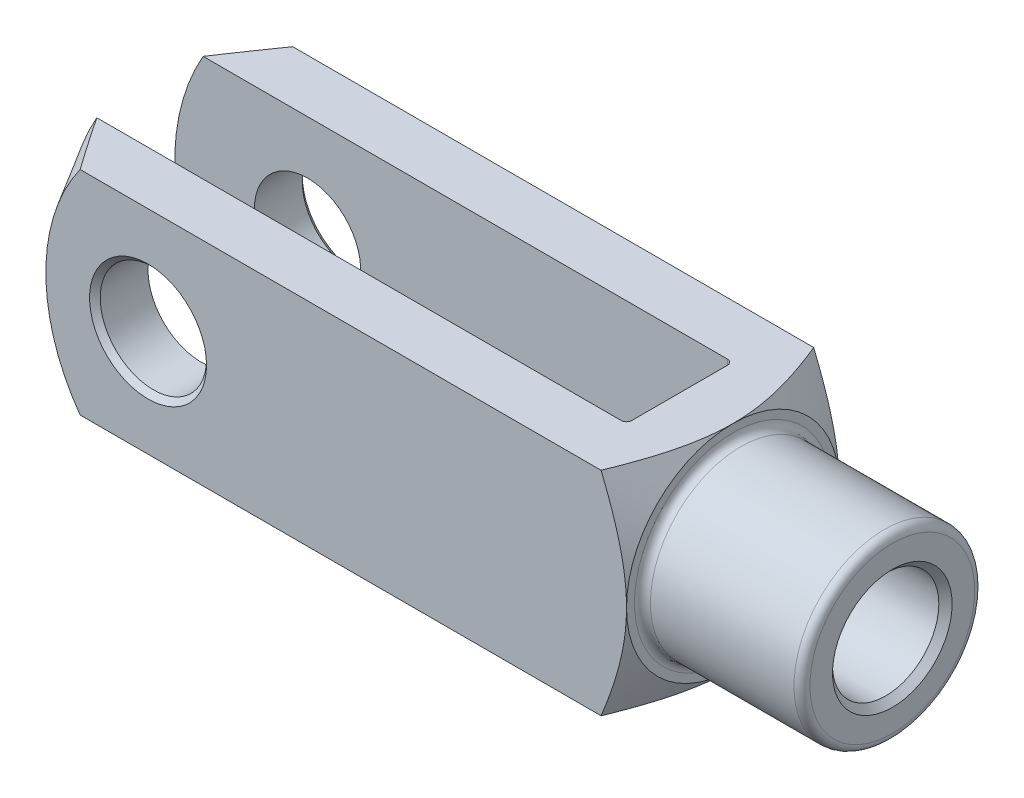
ISO-10303-21;
HEADER;
FILE_DESCRIPTION(('STEP AP214'),'2;1');
FILE_NAME('part.step','',(''),(''),'','','');
FILE_SCHEMA(('AUTOMOTIVE_DESIGN { 1 0 10303 214 1 1 1 1 }'));
ENDSEC;
DATA;
#1=APPLICATION_CONTEXT('core data for automotive mechanical design processes');
#2=APPLICATION_PROTOCOL_DEFINITION('international standard','automotive_design',2000,#1);
#3=PRODUCT_CONTEXT('',#1,'mechanical');
#4=PRODUCT('Part','Part','',(#3));
#5=PRODUCT_RELATED_PRODUCT_CATEGORY('part','',(#4));
#6=PRODUCT_DEFINITION_FORMATION('','',#4);
#7=PRODUCT_DEFINITION_CONTEXT('part definition',#1,'design');
#8=PRODUCT_DEFINITION('design','',#6,#7);
#9=PRODUCT_DEFINITION_SHAPE('','',#8);
#10=(LENGTH_UNIT() NAMED_UNIT(*) SI_UNIT(.MILLI.,.METRE.));
#11=(NAMED_UNIT(*) PLANE_ANGLE_UNIT() SI_UNIT($,.RADIAN.));
#12=(NAMED_UNIT(*) SI_UNIT($,.STERADIAN.) SOLID_ANGLE_UNIT());
#13=UNCERTAINTY_MEASURE_WITH_UNIT(LENGTH_MEASURE(1.E-05),#10,'distance_accuracy_value','');
#14=(GEOMETRIC_REPRESENTATION_CONTEXT(3) GLOBAL_UNCERTAINTY_ASSIGNED_CONTEXT((#13)) GLOBAL_UNIT_ASSIGNED_CONTEXT((#10,
#11,#12)) REPRESENTATION_CONTEXT('',''));
#15=CARTESIAN_POINT('',(0.,0.,0.));
#16=DIRECTION('',(0.,0.,1.));
#17=DIRECTION('',(1.,0.,0.));
#18=AXIS2_PLACEMENT_3D('',#15,#16,#17);
#19=CARTESIAN_POINT('',(-41.,-20.,-8.99999999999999));
#20=DIRECTION('',(0.,-1.,0.));
#21=DIRECTION('',(0.,0.,-1.));
#22=AXIS2_PLACEMENT_3D('',#19,#20,#21);
#23=CYLINDRICAL_SURFACE('',#22,1.);
#24=DIRECTION('',(0.,1.,0.));
#25=VECTOR('',#24,1.);
#26=CARTESIAN_POINT('',(-40.,-20.,-8.99999999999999));
#27=LINE('',#26,#25);
#28=CARTESIAN_POINT('',(-40.,-4.3588989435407,-8.99999999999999));
#29=VERTEX_POINT('',#28);
#30=CARTESIAN_POINT('',(-40.,-20.,-8.99999999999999));
#31=VERTEX_POINT('',#30);
#32=EDGE_CURVE('E358',#29,#31,#27,.F.);
#33=ORIENTED_EDGE('',*,*,#32,.F.);
#34=CARTESIAN_POINT('',(-40.,-4.3588989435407,-8.99999999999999));
#35=CARTESIAN_POINT('',(-40.0000151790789,-4.28657646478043,-9.03502940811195));
#36=CARTESIAN_POINT('',(-40.0018397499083,-4.21384835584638,-9.06917502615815));
#37=CARTESIAN_POINT('',(-40.0086750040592,-4.06774424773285,-9.13563818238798));
#38=CARTESIAN_POINT('',(-40.0136843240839,-3.99436853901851,-9.1679564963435));
#39=CARTESIAN_POINT('',(-40.0264446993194,-3.84721416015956,-9.23067336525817));
#40=CARTESIAN_POINT('',(-40.0341903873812,-3.77343655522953,-9.26107554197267));
#41=CARTESIAN_POINT('',(-40.0520865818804,-3.62542416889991,-9.32001323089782));
#42=CARTESIAN_POINT('',(-40.0622373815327,-3.55118933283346,-9.34854851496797));
#43=CARTESIAN_POINT('',(-40.0957491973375,-3.32854256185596,-9.4311073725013));
#44=CARTESIAN_POINT('',(-40.1222296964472,-3.17955672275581,-9.48235268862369));
#45=CARTESIAN_POINT('',(-40.1816529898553,-2.88046339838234,-9.57745203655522));
#46=CARTESIAN_POINT('',(-40.2145999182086,-2.73035525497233,-9.62130130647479));
#47=CARTESIAN_POINT('',(-40.2998777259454,-2.36825595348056,-9.71798906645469));
#48=CARTESIAN_POINT('',(-40.3546487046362,-2.1558749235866,-9.76725305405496));
#49=CARTESIAN_POINT('',(-40.470872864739,-1.73020697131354,-9.85157380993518));
#50=CARTESIAN_POINT('',(-40.5323270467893,-1.51691991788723,-9.88662844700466));
#51=CARTESIAN_POINT('',(-40.7230029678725,-0.876019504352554,-9.97086857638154));
#52=CARTESIAN_POINT('',(-40.8585728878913,-0.447232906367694,-9.99916563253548));
#53=CARTESIAN_POINT('',(-40.995979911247,-0.0127126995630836,-9.99999393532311));
#54=CARTESIAN_POINT('',(-40.9979899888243,-0.00635627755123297,-9.99999999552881));
#55=CARTESIAN_POINT('',(-41.,0.,-9.99999999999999));
#56=B_SPLINE_CURVE_WITH_KNOTS('',3,(#34,#35,#36,#37,#38,#39,#40,#41,#42,#43,#44,#45,#46,#47,#48,
#49,#50,#51,#52,#53,#54,#55),.UNSPECIFIED.,.F.,.F.,(4,2,2,2,2,2,2,2,2,2,4),(0.,0.24102239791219,
0.48194169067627,0.722391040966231,0.962869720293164,1.44176483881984,1.9209671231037,
2.59465687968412,3.26844764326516,4.61560355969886,4.63560356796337),.UNSPECIFIED.);
#57=CARTESIAN_POINT('',(-41.,0.,-9.99999999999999));
#58=VERTEX_POINT('',#57);
#59=EDGE_CURVE('E392',#29,#58,#56,.T.);
#60=ORIENTED_EDGE('',*,*,#59,.T.);
#61=DIRECTION('',(0.,1.,0.));
#62=VECTOR('',#61,1.);
#63=CARTESIAN_POINT('',(-41.,20.,-9.99999999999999));
#64=LINE('',#63,#62);
#65=CARTESIAN_POINT('',(-41.,-20.,-9.99999999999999));
#66=VERTEX_POINT('',#65);
#67=EDGE_CURVE('E183',#66,#58,#64,.T.);
#68=ORIENTED_EDGE('',*,*,#67,.F.);
#69=CARTESIAN_POINT('',(-41.,-20.,-8.99999999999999));
#70=DIRECTION('',(0.,-1.,0.));
#71=DIRECTION('',(0.,0.,-1.));
#72=AXIS2_PLACEMENT_3D('',#69,#70,#71);
#73=CIRCLE('',#72,1.);
#74=EDGE_CURVE('E198',#31,#66,#73,.F.);
#75=ORIENTED_EDGE('',*,*,#74,.F.);
#76=EDGE_LOOP('',(#33,#60,#68,#75));
#77=FACE_BOUND('',#76,.T.);
#78=ADVANCED_FACE('F37',(#77),#23,.F.);
#79=CARTESIAN_POINT('',(-40.,-20.,-9.99999999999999));
#80=DIRECTION('',(1.,0.,0.));
#81=DIRECTION('',(0.,0.,-1.));
#82=AXIS2_PLACEMENT_3D('',#79,#80,#81);
#83=PLANE('',#82);
#84=CARTESIAN_POINT('',(-40.,20.,-8.99999999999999));
#85=VERTEX_POINT('',#84);
#86=CARTESIAN_POINT('',(-40.,4.3588989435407,-8.99999999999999));
#87=VERTEX_POINT('',#86);
#88=EDGE_CURVE('E374',#85,#87,#27,.F.);
#89=ORIENTED_EDGE('',*,*,#88,.T.);
#90=CARTESIAN_POINT('',(-40.,0.,0.));
#91=DIRECTION('',(1.,0.,0.));
#92=DIRECTION('',(0.,0.,-1.));
#93=AXIS2_PLACEMENT_3D('',#90,#91,#92);
#94=CIRCLE('',#93,10.);
#95=CARTESIAN_POINT('',(-40.,4.35889894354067,9.));
#96=VERTEX_POINT('',#95);
#97=EDGE_CURVE('E457',#87,#96,#94,.T.);
#98=ORIENTED_EDGE('',*,*,#97,.T.);
#99=DIRECTION('',(0.,1.,0.));
#100=VECTOR('',#99,1.);
#101=CARTESIAN_POINT('',(-40.,20.,9.));
#102=LINE('',#101,#100);
#103=CARTESIAN_POINT('',(-40.,20.,9.));
#104=VERTEX_POINT('',#103);
#105=EDGE_CURVE('E160',#96,#104,#102,.T.);
#106=ORIENTED_EDGE('',*,*,#105,.T.);
#107=DIRECTION('',(0.,0.,-1.));
#108=VECTOR('',#107,1.);
#109=CARTESIAN_POINT('',(-40.,20.,-9.99999999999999));
#110=LINE('',#109,#108);
#111=EDGE_CURVE('E338',#104,#85,#110,.T.);
#112=ORIENTED_EDGE('',*,*,#111,.T.);
#113=EDGE_LOOP('',(#89,#98,#106,#112));
#114=FACE_BOUND('',#113,.T.);
#115=ADVANCED_FACE('F497',(#114),#83,.F.);
#116=CARTESIAN_POINT('',(-41.,-20.,9.));
#117=DIRECTION('',(0.,-1.,0.));
#118=DIRECTION('',(0.,0.,-1.));
#119=AXIS2_PLACEMENT_3D('',#116,#117,#118);
#120=CYLINDRICAL_SURFACE('',#119,1.);
#121=ORIENTED_EDGE('',*,*,#105,.F.);
#122=CARTESIAN_POINT('',(-40.,4.35889894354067,9.));
#123=CARTESIAN_POINT('',(-40.0000151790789,4.28657646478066,9.03502940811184));
#124=CARTESIAN_POINT('',(-40.0018397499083,4.21384835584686,9.06917502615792));
#125=CARTESIAN_POINT('',(-40.0086750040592,4.06774424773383,9.13563818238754));
#126=CARTESIAN_POINT('',(-40.0136843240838,3.99436853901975,9.16795649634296));
#127=CARTESIAN_POINT('',(-40.0264446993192,3.84721416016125,9.23067336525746));
#128=CARTESIAN_POINT('',(-40.0341903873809,3.77343655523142,9.26107554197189));
#129=CARTESIAN_POINT('',(-40.0520865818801,3.62542416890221,9.32001323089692));
#130=CARTESIAN_POINT('',(-40.0622373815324,3.55118933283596,9.34854851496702));
#131=CARTESIAN_POINT('',(-40.0957491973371,3.32854256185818,9.43110737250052));
#132=CARTESIAN_POINT('',(-40.1222296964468,3.17955672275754,9.48235268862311));
#133=CARTESIAN_POINT('',(-40.1816529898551,2.88046339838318,9.57745203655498));
#134=CARTESIAN_POINT('',(-40.2145999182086,2.73035525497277,9.62130130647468));
#135=CARTESIAN_POINT('',(-40.2998777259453,2.36825595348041,9.71798906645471));
#136=CARTESIAN_POINT('',(-40.3546487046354,2.15587492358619,9.767253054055));
#137=CARTESIAN_POINT('',(-40.4708728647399,1.73020697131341,9.85157380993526));
#138=CARTESIAN_POINT('',(-40.5323270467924,1.51691991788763,9.88662844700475));
#139=CARTESIAN_POINT('',(-40.7230029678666,0.876019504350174,9.97086857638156));
#140=CARTESIAN_POINT('',(-40.8585728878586,0.447232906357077,9.99916563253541));
#141=CARTESIAN_POINT('',(-40.995979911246,0.0127126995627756,9.99999393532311));
#142=CARTESIAN_POINT('',(-40.9979899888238,0.00635627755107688,9.99999999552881));
#143=CARTESIAN_POINT('',(-41.,0.,10.));
#144=B_SPLINE_CURVE_WITH_KNOTS('',3,(#122,#123,#124,#125,#126,#127,#128,#129,#130,#131,#132,
#133,#134,#135,#136,#137,#138,#139,#140,#141,#142,#143),.UNSPECIFIED.,.F.,.F.,(4,2,2,2,2,2,2,2,
2,2,4),(0.,0.241022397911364,0.48194169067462,0.722391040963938,0.962869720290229,
1.44176483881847,1.92096712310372,2.59465687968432,3.26844764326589,4.61560355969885,
4.63560356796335),.UNSPECIFIED.);
#145=CARTESIAN_POINT('',(-41.,0.,10.));
#146=VERTEX_POINT('',#145);
#147=EDGE_CURVE('E145',#96,#146,#144,.T.);
#148=ORIENTED_EDGE('',*,*,#147,.T.);
#149=DIRECTION('',(0.,1.,0.));
#150=VECTOR('',#149,1.);
#151=CARTESIAN_POINT('',(-41.,-20.,10.));
#152=LINE('',#151,#150);
#153=CARTESIAN_POINT('',(-41.,20.,10.));
#154=VERTEX_POINT('',#153);
#155=EDGE_CURVE('E159',#154,#146,#152,.F.);
#156=ORIENTED_EDGE('',*,*,#155,.F.);
#157=CARTESIAN_POINT('',(-41.,20.,9.));
#158=DIRECTION('',(0.,1.,0.));
#159=DIRECTION('',(0.,0.,1.));
#160=AXIS2_PLACEMENT_3D('',#157,#158,#159);
#161=CIRCLE('',#160,1.);
#162=EDGE_CURVE('E190',#104,#154,#161,.F.);
#163=ORIENTED_EDGE('',*,*,#162,.F.);
#164=EDGE_LOOP('',(#121,#148,#156,#163));
#165=FACE_BOUND('',#164,.T.);
#166=ADVANCED_FACE('F156',(#165),#120,.F.);
#167=CARTESIAN_POINT('',(-145.,-20.,-9.99999999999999));
#168=DIRECTION('',(0.,0.,-1.));
#169=DIRECTION('',(-1.,0.,0.));
#170=AXIS2_PLACEMENT_3D('',#167,#168,#169);
#171=PLANE('',#170);
#172=CARTESIAN_POINT('',(-120.,0.,-9.99999999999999));
#173=DIRECTION('',(0.,0.,-1.));
#174=DIRECTION('',(-1.,0.,0.));
#175=AXIS2_PLACEMENT_3D('',#172,#173,#174);
#176=CIRCLE('',#175,9.99999999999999);
#177=CARTESIAN_POINT('',(-130.,0.,-9.99999999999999));
#178=VERTEX_POINT('',#177);
#179=EDGE_CURVE('E368',#178,#178,#176,.F.);
#180=ORIENTED_EDGE('',*,*,#179,.F.);
#181=EDGE_LOOP('',(#180));
#182=FACE_BOUND('',#181,.T.);
#183=CARTESIAN_POINT('',(-105.,0.,-9.99999999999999));
#184=DIRECTION('',(0.,0.,1.));
#185=DIRECTION('',(1.,0.,0.));
#186=AXIS2_PLACEMENT_3D('',#183,#184,#185);
#187=CIRCLE('',#186,40.);
#188=CARTESIAN_POINT('',(-139.641016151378,20.,-9.99999999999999));
#189=VERTEX_POINT('',#188);
#190=CARTESIAN_POINT('',(-139.641016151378,-20.,-9.99999999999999));
#191=VERTEX_POINT('',#190);
#192=EDGE_CURVE('E276',#189,#191,#187,.T.);
#193=ORIENTED_EDGE('',*,*,#192,.T.);
#194=DIRECTION('',(-1.,0.,0.));
#195=VECTOR('',#194,1.);
#196=CARTESIAN_POINT('',(-145.,-20.,-9.99999999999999));
#197=LINE('',#196,#195);
#198=EDGE_CURVE('E333',#66,#191,#197,.T.);
#199=ORIENTED_EDGE('',*,*,#198,.F.);
#200=ORIENTED_EDGE('',*,*,#67,.T.);
#201=CARTESIAN_POINT('',(-41.,20.,-9.99999999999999));
#202=VERTEX_POINT('',#201);
#203=EDGE_CURVE('E179',#58,#202,#64,.T.);
#204=ORIENTED_EDGE('',*,*,#203,.T.);
#205=DIRECTION('',(-1.,0.,0.));
#206=VECTOR('',#205,1.);
#207=CARTESIAN_POINT('',(-145.,20.,-9.99999999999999));
#208=LINE('',#207,#206);
#209=EDGE_CURVE('E346',#202,#189,#208,.T.);
#210=ORIENTED_EDGE('',*,*,#209,.T.);
#211=EDGE_LOOP('',(#193,#199,#200,#204,#210));
#212=FACE_BOUND('',#211,.T.);
#213=ADVANCED_FACE('F395',(#182,#212),#171,.F.);
#214=CARTESIAN_POINT('',(-145.,-20.,10.));
#215=DIRECTION('',(0.,0.,1.));
#216=DIRECTION('',(1.,0.,0.));
#217=AXIS2_PLACEMENT_3D('',#214,#215,#216);
#218=PLANE('',#217);
#219=CARTESIAN_POINT('',(-120.,0.,10.));
#220=DIRECTION('',(0.,0.,1.));
#221=DIRECTION('',(1.,0.,0.));
#222=AXIS2_PLACEMENT_3D('',#219,#220,#221);
#223=CIRCLE('',#222,9.99999999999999);
#224=CARTESIAN_POINT('',(-110.,0.,10.));
#225=VERTEX_POINT('',#224);
#226=EDGE_CURVE('E345',#225,#225,#223,.F.);
#227=ORIENTED_EDGE('',*,*,#226,.F.);
#228=EDGE_LOOP('',(#227));
#229=FACE_BOUND('',#228,.T.);
#230=DIRECTION('',(1.,0.,0.));
#231=VECTOR('',#230,1.);
#232=CARTESIAN_POINT('',(-145.,-20.,10.));
#233=LINE('',#232,#231);
#234=CARTESIAN_POINT('',(-139.641016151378,-20.,10.));
#235=VERTEX_POINT('',#234);
#236=CARTESIAN_POINT('',(-41.,-20.,10.));
#237=VERTEX_POINT('',#236);
#238=EDGE_CURVE('E337',#235,#237,#233,.T.);
#239=ORIENTED_EDGE('',*,*,#238,.F.);
#240=CARTESIAN_POINT('',(-105.,0.,10.));
#241=DIRECTION('',(0.,0.,1.));
#242=DIRECTION('',(1.,0.,0.));
#243=AXIS2_PLACEMENT_3D('',#240,#241,#242);
#244=CIRCLE('',#243,40.);
#245=CARTESIAN_POINT('',(-139.641016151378,20.,10.));
#246=VERTEX_POINT('',#245);
#247=EDGE_CURVE('E419',#246,#235,#244,.T.);
#248=ORIENTED_EDGE('',*,*,#247,.F.);
#249=DIRECTION('',(1.,0.,0.));
#250=VECTOR('',#249,1.);
#251=CARTESIAN_POINT('',(-145.,20.,10.));
#252=LINE('',#251,#250);
#253=EDGE_CURVE('E176',#246,#154,#252,.T.);
#254=ORIENTED_EDGE('',*,*,#253,.T.);
#255=ORIENTED_EDGE('',*,*,#155,.T.);
#256=EDGE_CURVE('E164',#146,#237,#152,.F.);
#257=ORIENTED_EDGE('',*,*,#256,.T.);
#258=EDGE_LOOP('',(#239,#248,#254,#255,#257));
#259=FACE_BOUND('',#258,.T.);
#260=ADVANCED_FACE('F173',(#229,#259),#218,.F.);
#261=CARTESIAN_POINT('',(-145.,-20.,20.));
#262=DIRECTION('',(0.,0.,1.));
#263=DIRECTION('',(1.,0.,0.));
#264=AXIS2_PLACEMENT_3D('',#261,#262,#263);
#265=PLANE('',#264);
#266=CARTESIAN_POINT('',(-120.,0.,20.));
#267=DIRECTION('',(0.,0.,1.));
#268=DIRECTION('',(1.,0.,0.));
#269=AXIS2_PLACEMENT_3D('',#266,#267,#268);
#270=CIRCLE('',#269,11.);
#271=CARTESIAN_POINT('',(-109.,0.,20.));
#272=VERTEX_POINT('',#271);
#273=EDGE_CURVE('E228',#272,#272,#270,.F.);
#274=ORIENTED_EDGE('',*,*,#273,.T.);
#275=EDGE_LOOP('',(#274));
#276=FACE_BOUND('',#275,.T.);
#277=DIRECTION('',(1.,0.,0.));
#278=VECTOR('',#277,1.);
#279=CARTESIAN_POINT('',(-145.,20.,20.));
#280=LINE('',#279,#278);
#281=CARTESIAN_POINT('',(-132.775044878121,20.,20.));
#282=VERTEX_POINT('',#281);
#283=CARTESIAN_POINT('',(-34.7829262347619,20.,20.));
#284=VERTEX_POINT('',#283);
#285=EDGE_CURVE('E365',#282,#284,#280,.T.);
#286=ORIENTED_EDGE('',*,*,#285,.F.);
#287=CARTESIAN_POINT('',(-105.,0.,20.));
#288=DIRECTION('',(0.,0.,1.));
#289=DIRECTION('',(1.,0.,0.));
#290=AXIS2_PLACEMENT_3D('',#287,#288,#289);
#291=CIRCLE('',#290,34.2264973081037);
#292=CARTESIAN_POINT('',(-132.775044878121,-20.,20.));
#293=VERTEX_POINT('',#292);
#294=EDGE_CURVE('E61',#282,#293,#291,.T.);
#295=ORIENTED_EDGE('',*,*,#294,.T.);
#296=DIRECTION('',(1.,0.,0.));
#297=VECTOR('',#296,1.);
#298=CARTESIAN_POINT('',(-145.,-20.,20.));
#299=LINE('',#298,#297);
#300=CARTESIAN_POINT('',(-34.7829262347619,-20.,20.));
#301=VERTEX_POINT('',#300);
#302=EDGE_CURVE('E362',#293,#301,#299,.T.);
#303=ORIENTED_EDGE('',*,*,#302,.T.);
#304=CARTESIAN_POINT('',(-44.7117469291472,-40.8480870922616,20.));
#305=CARTESIAN_POINT('',(-44.4561917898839,-40.3552393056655,20.));
#306=CARTESIAN_POINT('',(-44.2013369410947,-39.8620284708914,20.));
#307=CARTESIAN_POINT('',(-43.693177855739,-38.874806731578,20.));
#308=CARTESIAN_POINT('',(-43.4398736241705,-38.3807958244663,20.));
#309=CARTESIAN_POINT('',(-42.6824888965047,-36.8974069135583,20.));
#310=CARTESIAN_POINT('',(-42.1809621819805,-35.9067224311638,20.));
#311=CARTESIAN_POINT('',(-41.18538005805,-33.9194417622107,20.));
#312=CARTESIAN_POINT('',(-40.6913391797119,-32.9228382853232,20.));
#313=CARTESIAN_POINT('',(-39.7136550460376,-30.9245603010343,20.));
#314=CARTESIAN_POINT('',(-39.2300116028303,-29.9228858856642,20.));
#315=CARTESIAN_POINT('',(-38.2464042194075,-27.8515018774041,20.));
#316=CARTESIAN_POINT('',(-37.7472668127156,-26.7813979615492,20.));
#317=CARTESIAN_POINT('',(-37.0128527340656,-25.1696896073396,20.));
#318=CARTESIAN_POINT('',(-36.7704219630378,-24.6313428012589,20.));
#319=CARTESIAN_POINT('',(-36.2910428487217,-23.5522150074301,20.));
#320=CARTESIAN_POINT('',(-36.0540944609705,-23.0114340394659,20.));
#321=CARTESIAN_POINT('',(-35.5865923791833,-21.9273871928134,20.));
#322=CARTESIAN_POINT('',(-35.356035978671,-21.3841224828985,20.));
#323=CARTESIAN_POINT('',(-34.9021820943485,-20.2945711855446,20.));
#324=CARTESIAN_POINT('',(-34.6788845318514,-19.748284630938,20.));
#325=CARTESIAN_POINT('',(-34.2407069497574,-18.6523948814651,20.));
#326=CARTESIAN_POINT('',(-34.0258261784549,-18.1027919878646,20.));
#327=CARTESIAN_POINT('',(-33.6058159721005,-16.999875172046,20.));
#328=CARTESIAN_POINT('',(-33.4006864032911,-16.4465613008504,20.));
#329=CARTESIAN_POINT('',(-32.9584948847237,-15.2154115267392,20.));
#330=CARTESIAN_POINT('',(-32.724154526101,-14.5365922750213,20.));
#331=CARTESIAN_POINT('',(-32.2756396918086,-13.1723527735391,20.));
#332=CARTESIAN_POINT('',(-32.061463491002,-12.4869330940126,20.));
#333=CARTESIAN_POINT('',(-31.6572524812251,-11.1089764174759,20.));
#334=CARTESIAN_POINT('',(-31.4672171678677,-10.4164395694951,20.));
#335=CARTESIAN_POINT('',(-31.115826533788,-9.02406913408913,20.));
#336=CARTESIAN_POINT('',(-30.9544708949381,-8.32423562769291,20.));
#337=CARTESIAN_POINT('',(-30.6686985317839,-6.93411418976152,20.));
#338=CARTESIAN_POINT('',(-30.543503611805,-6.24398781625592,20.));
#339=CARTESIAN_POINT('',(-30.329515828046,-4.85806653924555,20.));
#340=CARTESIAN_POINT('',(-30.2407217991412,-4.16227181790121,20.));
#341=CARTESIAN_POINT('',(-30.1032474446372,-2.76713808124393,20.));
#342=CARTESIAN_POINT('',(-30.0545409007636,-2.06780168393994,20.));
#343=CARTESIAN_POINT('',(-29.9993902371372,-0.667457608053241,20.));
#344=CARTESIAN_POINT('',(-29.9929446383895,0.0335500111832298,20.));
#345=CARTESIAN_POINT('',(-30.0215257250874,1.38358015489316,20.));
#346=CARTESIAN_POINT('',(-30.053564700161,2.03266864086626,20.));
#347=CARTESIAN_POINT('',(-30.1529107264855,3.32811214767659,20.));
#348=CARTESIAN_POINT('',(-30.2202176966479,3.97446717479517,20.));
#349=CARTESIAN_POINT('',(-30.3876322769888,5.26320613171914,20.));
#350=CARTESIAN_POINT('',(-30.4877568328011,5.90558783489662,20.));
#351=CARTESIAN_POINT('',(-30.7175054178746,7.18501977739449,20.));
#352=CARTESIAN_POINT('',(-30.8471302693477,7.82206986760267,20.));
#353=CARTESIAN_POINT('',(-31.1364002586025,9.10865741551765,20.));
#354=CARTESIAN_POINT('',(-31.2968057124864,9.75802261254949,20.));
#355=CARTESIAN_POINT('',(-31.6411635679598,11.0504361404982,20.));
#356=CARTESIAN_POINT('',(-31.8251161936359,11.6934844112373,20.));
#357=CARTESIAN_POINT('',(-32.2130089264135,12.9734650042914,20.));
#358=CARTESIAN_POINT('',(-32.4169481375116,13.6103975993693,20.));
#359=CARTESIAN_POINT('',(-32.7355110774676,14.5615046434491,20.));
#360=CARTESIAN_POINT('',(-32.8438059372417,14.8778200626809,20.));
#361=CARTESIAN_POINT('',(-33.0642784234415,15.5090943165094,20.));
#362=CARTESIAN_POINT('',(-33.1764560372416,15.8240531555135,20.));
#363=CARTESIAN_POINT('',(-33.5368964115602,16.8182188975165,20.));
#364=CARTESIAN_POINT('',(-33.7917035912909,17.4950585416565,20.));
#365=CARTESIAN_POINT('',(-34.315152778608,18.8433829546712,20.));
#366=CARTESIAN_POINT('',(-34.5837956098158,19.5148674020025,20.));
#367=CARTESIAN_POINT('',(-35.1326821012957,20.8532445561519,20.));
#368=CARTESIAN_POINT('',(-35.412928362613,21.5201361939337,20.));
#369=CARTESIAN_POINT('',(-35.9830913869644,22.8497479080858,20.));
#370=CARTESIAN_POINT('',(-36.2730079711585,23.5124680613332,20.));
#371=CARTESIAN_POINT('',(-36.86125118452,24.8348444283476,20.));
#372=CARTESIAN_POINT('',(-37.1595848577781,25.4944975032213,20.));
#373=CARTESIAN_POINT('',(-37.7631804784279,26.8106245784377,20.));
#374=CARTESIAN_POINT('',(-38.0684424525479,27.4670985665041,20.));
#375=CARTESIAN_POINT('',(-38.6848375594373,28.7771877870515,20.));
#376=CARTESIAN_POINT('',(-38.9959700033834,29.4308033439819,20.));
#377=CARTESIAN_POINT('',(-39.6233091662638,30.735596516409,20.));
#378=CARTESIAN_POINT('',(-39.9395159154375,31.3867741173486,20.));
#379=CARTESIAN_POINT('',(-40.896609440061,33.3410563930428,20.));
#380=CARTESIAN_POINT('',(-41.5440877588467,34.6409339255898,20.));
#381=CARTESIAN_POINT('',(-42.8522843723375,37.234022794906,20.));
#382=CARTESIAN_POINT('',(-43.5130029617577,38.5272339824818,20.));
#383=CARTESIAN_POINT('',(-44.8443480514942,41.1077325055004,20.));
#384=CARTESIAN_POINT('',(-45.5149695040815,42.3950224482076,20.));
#385=CARTESIAN_POINT('',(-46.8642487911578,44.9653657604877,20.));
#386=CARTESIAN_POINT('',(-47.5429065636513,46.2484191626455,20.));
#387=CARTESIAN_POINT('',(-48.8053932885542,48.6208089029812,20.));
#388=CARTESIAN_POINT('',(-49.3883375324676,49.7106165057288,20.));
#389=CARTESIAN_POINT('',(-50.5581313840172,51.8881346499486,20.));
#390=CARTESIAN_POINT('',(-51.1449809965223,52.9758451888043,20.));
#391=CARTESIAN_POINT('',(-52.3220562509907,55.1496344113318,20.));
#392=CARTESIAN_POINT('',(-52.9122823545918,56.2357128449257,20.));
#393=CARTESIAN_POINT('',(-54.0955388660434,58.4063411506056,20.));
#394=CARTESIAN_POINT('',(-54.6885692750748,59.4908910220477,20.));
#395=CARTESIAN_POINT('',(-55.8736310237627,61.6524632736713,20.));
#396=CARTESIAN_POINT('',(-56.4656486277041,62.7294931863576,20.));
#397=CARTESIAN_POINT('',(-57.651739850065,64.8824205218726,20.));
#398=CARTESIAN_POINT('',(-58.2458134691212,65.9583179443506,20.));
#399=CARTESIAN_POINT('',(-59.4356534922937,68.1089540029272,20.));
#400=CARTESIAN_POINT('',(-60.0314196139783,69.1836927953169,20.));
#401=CARTESIAN_POINT('',(-61.2245219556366,71.3322969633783,20.));
#402=CARTESIAN_POINT('',(-61.8218581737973,72.4061623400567,20.));
#403=CARTESIAN_POINT('',(-62.4198720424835,73.4796497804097,20.));
#404=B_SPLINE_CURVE_WITH_KNOTS('',3,(#304,#305,#306,#307,#308,#309,#310,#311,#312,#313,#314,
#315,#316,#317,#318,#319,#320,#321,#322,#323,#324,#325,#326,#327,#328,#329,#330,#331,#332,#333,
#334,#335,#336,#337,#338,#339,#340,#341,#342,#343,#344,#345,#346,#347,#348,#349,#350,#351,#352,
#353,#354,#355,#356,#357,#358,#359,#360,#361,#362,#363,#364,#365,#366,#367,#368,#369,#370,#371,
#372,#373,#374,#375,#376,#377,#378,#379,#380,#381,#382,#383,#384,#385,#386,#387,#388,#389,#390,
#391,#392,#393,#394,#395,#396,#397,#398,#399,#400,#401,#402,#403),.UNSPECIFIED.,.F.,.F.,(4,2,2,
2,2,2,2,2,2,2,2,2,2,2,2,2,2,2,2,2,2,2,2,2,2,2,2,2,2,2,2,2,2,2,2,2,2,2,2,2,2,2,2,2,2,2,2,2,2,4),
(0.,1.66549183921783,3.33098904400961,6.66215149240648,9.9991147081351,13.3360175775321,
16.8782159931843,18.6494369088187,20.4206434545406,22.1910882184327,23.961513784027,
25.7317808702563,27.5020236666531,29.6561476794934,31.8100872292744,33.9639817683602,
36.117852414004,38.2211628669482,40.3244059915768,42.4262724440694,44.5280653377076,
46.4767082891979,48.4253467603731,50.3749930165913,52.324693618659,54.3308265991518,
56.3369786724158,58.3430408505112,59.346040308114,60.3490365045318,62.5184742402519,
64.6880412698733,66.8580972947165,69.0281132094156,71.2000024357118,73.3719000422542,
75.5435443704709,77.7152016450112,82.0717130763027,86.4283215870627,90.7827812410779,
95.1372073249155,98.8449661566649,102.552729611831,106.261012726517,109.969297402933,
113.656340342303,117.343384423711,121.02984567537,124.716302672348),.UNSPECIFIED.);
#405=CARTESIAN_POINT('',(-30.,0.,20.));
#406=VERTEX_POINT('',#405);
#407=EDGE_CURVE('E305',#406,#301,#404,.F.);
#408=ORIENTED_EDGE('',*,*,#407,.F.);
#409=EDGE_CURVE('E303',#284,#406,#404,.F.);
#410=ORIENTED_EDGE('',*,*,#409,.F.);
#411=EDGE_LOOP('',(#286,#295,#303,#408,#410));
#412=FACE_BOUND('',#411,.T.);
#413=ADVANCED_FACE('F287',(#276,#412),#265,.T.);
#414=CARTESIAN_POINT('',(-145.,-20.,20.));
#415=DIRECTION('',(0.,-1.,0.));
#416=DIRECTION('',(0.,0.,-1.));
#417=AXIS2_PLACEMENT_3D('',#414,#415,#416);
#418=PLANE('',#417);
#419=ORIENTED_EDGE('',*,*,#198,.T.);
#420=CARTESIAN_POINT('',(-155.464255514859,-20.,14.7388337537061));
#421=CARTESIAN_POINT('',(-154.977726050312,-20.,13.9554262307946));
#422=CARTESIAN_POINT('',(-154.490511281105,-20.,13.1724443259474));
#423=CARTESIAN_POINT('',(-153.514581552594,-20.,11.6074156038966));
#424=CARTESIAN_POINT('',(-153.025866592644,-20.,10.8253687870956));
#425=CARTESIAN_POINT('',(-151.557258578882,-20.,8.48072725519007));
#426=CARTESIAN_POINT('',(-150.574921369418,-20.,6.91966204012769));
#427=CARTESIAN_POINT('',(-148.601276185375,-20.,3.80059817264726));
#428=CARTESIAN_POINT('',(-147.609958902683,-20.,2.2426054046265));
#429=CARTESIAN_POINT('',(-146.115876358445,-20.,-0.0898192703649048));
#430=CARTESIAN_POINT('',(-145.616667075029,-20.,-0.866529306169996));
#431=CARTESIAN_POINT('',(-144.615610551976,-20.,-2.41825426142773));
#432=CARTESIAN_POINT('',(-144.113763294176,-20.,-3.19326916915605));
#433=CARTESIAN_POINT('',(-142.561953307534,-20.,-5.57992347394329));
#434=CARTESIAN_POINT('',(-141.50712682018,-20.,-7.18841108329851));
#435=CARTESIAN_POINT('',(-139.912924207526,-20.,-9.59319983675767));
#436=CARTESIAN_POINT('',(-139.379531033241,-20.,-10.3934700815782));
#437=CARTESIAN_POINT('',(-138.308209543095,-20.,-11.9909680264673));
#438=CARTESIAN_POINT('',(-137.770281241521,-20.,-12.7881957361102));
#439=CARTESIAN_POINT('',(-136.689661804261,-20.,-14.378560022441));
#440=CARTESIAN_POINT('',(-136.146974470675,-20.,-15.1716991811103));
#441=CARTESIAN_POINT('',(-135.055691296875,-20.,-16.7539080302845));
#442=CARTESIAN_POINT('',(-134.507095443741,-20.,-17.5429777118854));
#443=CARTESIAN_POINT('',(-133.403112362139,-20.,-19.1163023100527));
#444=CARTESIAN_POINT('',(-132.847725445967,-20.,-19.90055744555));
#445=CARTESIAN_POINT('',(-131.729030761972,-20.,-21.4633921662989));
#446=CARTESIAN_POINT('',(-131.165723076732,-20.,-22.2419718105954));
#447=CARTESIAN_POINT('',(-130.035102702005,-20.,-23.7851048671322));
#448=CARTESIAN_POINT('',(-129.467876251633,-20.,-24.549721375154));
#449=CARTESIAN_POINT('',(-128.322623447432,-20.,-26.070859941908));
#450=CARTESIAN_POINT('',(-127.744596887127,-20.,-26.8273818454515));
#451=CARTESIAN_POINT('',(-126.574851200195,-20.,-28.3314583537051));
#452=CARTESIAN_POINT('',(-125.983114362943,-20.,-29.0789992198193));
#453=CARTESIAN_POINT('',(-124.784049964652,-20.,-30.561432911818));
#454=CARTESIAN_POINT('',(-124.176723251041,-20.,-31.2963264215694));
#455=CARTESIAN_POINT('',(-122.949334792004,-20.,-32.7424372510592));
#456=CARTESIAN_POINT('',(-122.329470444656,-20.,-33.4538210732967));
#457=CARTESIAN_POINT('',(-121.382190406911,-20.,-34.5053301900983));
#458=CARTESIAN_POINT('',(-121.063464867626,-20.,-34.8532924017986));
#459=CARTESIAN_POINT('',(-120.419506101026,-20.,-35.5431342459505));
#460=CARTESIAN_POINT('',(-120.094273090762,-20.,-35.8850140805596));
#461=CARTESIAN_POINT('',(-119.437235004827,-20.,-36.5609344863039));
#462=CARTESIAN_POINT('',(-119.105446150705,-20.,-36.8949907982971));
#463=CARTESIAN_POINT('',(-118.43367259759,-20.,-37.5548111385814));
#464=CARTESIAN_POINT('',(-118.093687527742,-20.,-37.8805747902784));
#465=CARTESIAN_POINT('',(-117.404695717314,-20.,-38.5220472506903));
#466=CARTESIAN_POINT('',(-117.055694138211,-20.,-38.8377615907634));
#467=CARTESIAN_POINT('',(-116.34735316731,-20.,-39.457330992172));
#468=CARTESIAN_POINT('',(-115.988015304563,-20.,-39.7611877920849));
#469=CARTESIAN_POINT('',(-115.433764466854,-20.,-40.2114960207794));
#470=CARTESIAN_POINT('',(-115.243111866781,-20.,-40.3632010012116));
#471=CARTESIAN_POINT('',(-114.858487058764,-20.,-40.6623387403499));
#472=CARTESIAN_POINT('',(-114.664514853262,-20.,-40.8097715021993));
#473=CARTESIAN_POINT('',(-114.077241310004,-20.,-41.2450393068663));
#474=CARTESIAN_POINT('',(-113.678634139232,-20.,-41.5258020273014));
#475=CARTESIAN_POINT('',(-112.866141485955,-20.,-42.0636748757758));
#476=CARTESIAN_POINT('',(-112.452268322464,-20.,-42.3208035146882));
#477=CARTESIAN_POINT('',(-111.607700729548,-20.,-42.8058851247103));
#478=CARTESIAN_POINT('',(-111.17701073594,-20.,-43.0338457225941));
#479=CARTESIAN_POINT('',(-110.398559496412,-20.,-43.405649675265));
#480=CARTESIAN_POINT('',(-110.054305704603,-20.,-43.5568168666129));
#481=CARTESIAN_POINT('',(-109.355718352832,-20.,-43.8338983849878));
#482=CARTESIAN_POINT('',(-109.001385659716,-20.,-43.9598148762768));
#483=CARTESIAN_POINT('',(-108.284109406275,-20.,-44.1824113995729));
#484=CARTESIAN_POINT('',(-107.921178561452,-20.,-44.2791320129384));
#485=CARTESIAN_POINT('',(-107.188106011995,-20.,-44.4400017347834));
#486=CARTESIAN_POINT('',(-106.817964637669,-20.,-44.5041523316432));
#487=CARTESIAN_POINT('',(-106.069490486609,-20.,-44.5976048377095));
#488=CARTESIAN_POINT('',(-105.691112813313,-20.,-44.6265519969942));
#489=CARTESIAN_POINT('',(-104.933349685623,-20.,-44.6470380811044));
#490=CARTESIAN_POINT('',(-104.553964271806,-20.,-44.6385784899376));
#491=CARTESIAN_POINT('',(-103.797786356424,-20.,-44.5846599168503));
#492=CARTESIAN_POINT('',(-103.420994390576,-20.,-44.5391935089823));
#493=CARTESIAN_POINT('',(-102.673309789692,-20.,-44.4133535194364));
#494=CARTESIAN_POINT('',(-102.302418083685,-20.,-44.3329744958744));
#495=CARTESIAN_POINT('',(-101.501082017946,-20.,-44.1227716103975));
#496=CARTESIAN_POINT('',(-101.072325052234,-20.,-43.9865486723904));
#497=CARTESIAN_POINT('',(-100.228715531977,-20.,-43.6760654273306));
#498=CARTESIAN_POINT('',(-99.8138708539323,-20.,-43.5017839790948));
#499=CARTESIAN_POINT('',(-99.2021903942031,-20.,-43.2164310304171));
#500=CARTESIAN_POINT('',(-98.9997370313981,-20.,-43.1171417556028));
#501=CARTESIAN_POINT('',(-98.5986091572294,-20.,-42.9113932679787));
#502=CARTESIAN_POINT('',(-98.3999330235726,-20.,-42.8049372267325));
#503=CARTESIAN_POINT('',(-98.0062245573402,-20.,-42.5855142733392));
#504=CARTESIAN_POINT('',(-97.8111921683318,-20.,-42.4725474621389));
#505=CARTESIAN_POINT('',(-97.424640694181,-20.,-42.2407087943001));
#506=CARTESIAN_POINT('',(-97.233122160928,-20.,-42.1218360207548));
#507=CARTESIAN_POINT('',(-96.539242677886,-20.,-41.67758758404));
#508=CARTESIAN_POINT('',(-96.0471261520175,-20.,-41.3361114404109));
#509=CARTESIAN_POINT('',(-95.0840622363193,-20.,-40.6244535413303));
#510=CARTESIAN_POINT('',(-94.613125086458,-20.,-40.2542581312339));
#511=CARTESIAN_POINT('',(-93.6888042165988,-20.,-39.4909076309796));
#512=CARTESIAN_POINT('',(-93.2354560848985,-20.,-39.0977096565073));
#513=CARTESIAN_POINT('',(-92.3447584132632,-20.,-38.2938363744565));
#514=CARTESIAN_POINT('',(-91.9074062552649,-20.,-37.8831639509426));
#515=CARTESIAN_POINT('',(-91.043477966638,-20.,-37.0449994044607));
#516=CARTESIAN_POINT('',(-90.6169935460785,-20.,-36.6174131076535));
#517=CARTESIAN_POINT('',(-89.7759134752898,-20.,-35.7507127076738));
#518=CARTESIAN_POINT('',(-89.3613182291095,-20.,-35.3115982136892));
#519=CARTESIAN_POINT('',(-88.542832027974,-20.,-34.4243699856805));
#520=CARTESIAN_POINT('',(-88.1389304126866,-20.,-33.9762660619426));
#521=CARTESIAN_POINT('',(-87.3400472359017,-20.,-33.0722099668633));
#522=CARTESIAN_POINT('',(-86.9450655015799,-20.,-32.6162579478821));
#523=CARTESIAN_POINT('',(-86.0007892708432,-20.,-31.5074230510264));
#524=CARTESIAN_POINT('',(-85.4553790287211,-20.,-30.8512338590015));
#525=CARTESIAN_POINT('',(-84.3773944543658,-20.,-29.5282176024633));
#526=CARTESIAN_POINT('',(-83.8448226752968,-20.,-28.8613884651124));
#527=CARTESIAN_POINT('',(-82.7986511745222,-20.,-27.5294654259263));
#528=CARTESIAN_POINT('',(-82.2848857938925,-20.,-26.8645014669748));
#529=CARTESIAN_POINT('',(-81.5210718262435,-20.,-25.8620207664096));
#530=CARTESIAN_POINT('',(-81.2676429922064,-20.,-25.5270710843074));
#531=CARTESIAN_POINT('',(-80.7628770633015,-20.,-24.8556040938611));
#532=CARTESIAN_POINT('',(-80.5115399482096,-20.,-24.519086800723));
#533=CARTESIAN_POINT('',(-80.2611662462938,-20.,-24.1818536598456));
#534=B_SPLINE_CURVE_WITH_KNOTS('',3,(#420,#421,#422,#423,#424,#425,#426,#427,#428,#429,#430,
#431,#432,#433,#434,#435,#436,#437,#438,#439,#440,#441,#442,#443,#444,#445,#446,#447,#448,#449,
#450,#451,#452,#453,#454,#455,#456,#457,#458,#459,#460,#461,#462,#463,#464,#465,#466,#467,#468,
#469,#470,#471,#472,#473,#474,#475,#476,#477,#478,#479,#480,#481,#482,#483,#484,#485,#486,#487,
#488,#489,#490,#491,#492,#493,#494,#495,#496,#497,#498,#499,#500,#501,#502,#503,#504,#505,#506,
#507,#508,#509,#510,#511,#512,#513,#514,#515,#516,#517,#518,#519,#520,#521,#522,#523,#524,#525,
#526,#527,#528,#529,#530,#531,#532,#533),.UNSPECIFIED.,.F.,.F.,(4,2,2,2,2,2,2,2,2,2,2,2,2,2,2,2,
2,2,2,2,2,2,2,2,2,2,2,2,2,2,2,2,2,2,2,2,2,2,2,2,2,2,2,2,2,2,2,2,2,2,2,2,2,2,2,2,4),(0.,
2.76657575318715,5.5331526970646,11.0664145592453,16.6062810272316,19.3761848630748,
22.1461077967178,27.9165467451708,30.8017500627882,33.6869442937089,36.5700122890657,
39.4530865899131,42.3360288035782,45.2189409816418,48.0749879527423,50.9310895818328,
53.7911127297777,56.6509807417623,59.4811890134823,60.8967393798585,62.3122426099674,
63.724598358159,65.1370181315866,66.5486465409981,67.9600671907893,68.6909476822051,
69.4218276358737,70.8837854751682,72.344588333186,73.8050084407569,74.9321155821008,
76.0591260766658,77.1845627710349,78.3099480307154,79.446582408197,80.5831716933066,
81.7199891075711,82.8569837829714,84.2044814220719,85.5527294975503,86.2290826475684,
86.9051384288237,87.5811837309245,88.2573343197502,90.0527538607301,91.849032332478,
93.6487735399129,95.4482188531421,97.2597072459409,99.071257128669,100.880927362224,
102.690562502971,105.250134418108,107.810211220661,110.331064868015,111.591120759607,
112.851164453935),.UNSPECIFIED.);
#535=CARTESIAN_POINT('',(-132.775044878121,-20.,-20.));
#536=VERTEX_POINT('',#535);
#537=EDGE_CURVE('E275',#191,#536,#534,.T.);
#538=ORIENTED_EDGE('',*,*,#537,.T.);
#539=DIRECTION('',(1.,0.,0.));
#540=VECTOR('',#539,1.);
#541=CARTESIAN_POINT('',(-145.,-20.,-20.));
#542=LINE('',#541,#540);
#543=CARTESIAN_POINT('',(-34.7829262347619,-20.,-20.));
#544=VERTEX_POINT('',#543);
#545=EDGE_CURVE('E359',#536,#544,#542,.T.);
#546=ORIENTED_EDGE('',*,*,#545,.T.);
#547=CARTESIAN_POINT('',(-44.7117469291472,-20.,-40.8480870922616));
#548=CARTESIAN_POINT('',(-44.4561917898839,-20.,-40.3552393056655));
#549=CARTESIAN_POINT('',(-44.2013369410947,-20.,-39.8620284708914));
#550=CARTESIAN_POINT('',(-43.693177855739,-20.,-38.874806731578));
#551=CARTESIAN_POINT('',(-43.4398736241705,-20.,-38.3807958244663));
#552=CARTESIAN_POINT('',(-42.6824888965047,-20.,-36.8974069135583));
#553=CARTESIAN_POINT('',(-42.1809621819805,-20.,-35.9067224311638));
#554=CARTESIAN_POINT('',(-41.18538005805,-20.,-33.9194417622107));
#555=CARTESIAN_POINT('',(-40.6913391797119,-20.,-32.9228382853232));
#556=CARTESIAN_POINT('',(-39.7136550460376,-20.,-30.9245603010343));
#557=CARTESIAN_POINT('',(-39.2300116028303,-20.,-29.9228858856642));
#558=CARTESIAN_POINT('',(-38.2464042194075,-20.,-27.8515018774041));
#559=CARTESIAN_POINT('',(-37.7472668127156,-20.,-26.7813979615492));
#560=CARTESIAN_POINT('',(-37.0128527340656,-20.,-25.1696896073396));
#561=CARTESIAN_POINT('',(-36.7704219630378,-20.,-24.6313428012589));
#562=CARTESIAN_POINT('',(-36.2910428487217,-20.,-23.5522150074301));
#563=CARTESIAN_POINT('',(-36.0540944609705,-20.,-23.0114340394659));
#564=CARTESIAN_POINT('',(-35.5865923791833,-20.,-21.9273871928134));
#565=CARTESIAN_POINT('',(-35.356035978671,-20.,-21.3841224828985));
#566=CARTESIAN_POINT('',(-34.9021820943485,-20.,-20.2945711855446));
#567=CARTESIAN_POINT('',(-34.6788845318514,-20.,-19.748284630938));
#568=CARTESIAN_POINT('',(-34.2407069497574,-20.,-18.6523948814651));
#569=CARTESIAN_POINT('',(-34.0258261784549,-20.,-18.1027919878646));
#570=CARTESIAN_POINT('',(-33.6058159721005,-20.,-16.999875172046));
#571=CARTESIAN_POINT('',(-33.4006864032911,-20.,-16.4465613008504));
#572=CARTESIAN_POINT('',(-32.9584948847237,-20.,-15.2154115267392));
#573=CARTESIAN_POINT('',(-32.724154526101,-20.,-14.5365922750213));
#574=CARTESIAN_POINT('',(-32.2756396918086,-20.,-13.1723527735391));
#575=CARTESIAN_POINT('',(-32.061463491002,-20.,-12.4869330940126));
#576=CARTESIAN_POINT('',(-31.6572524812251,-20.,-11.1089764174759));
#577=CARTESIAN_POINT('',(-31.4672171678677,-20.,-10.4164395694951));
#578=CARTESIAN_POINT('',(-31.115826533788,-20.,-9.02406913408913));
#579=CARTESIAN_POINT('',(-30.9544708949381,-20.,-8.32423562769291));
#580=CARTESIAN_POINT('',(-30.6686985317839,-20.,-6.93411418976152));
#581=CARTESIAN_POINT('',(-30.543503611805,-20.,-6.24398781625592));
#582=CARTESIAN_POINT('',(-30.329515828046,-20.,-4.85806653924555));
#583=CARTESIAN_POINT('',(-30.2407217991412,-20.,-4.16227181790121));
#584=CARTESIAN_POINT('',(-30.1032474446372,-20.,-2.76713808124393));
#585=CARTESIAN_POINT('',(-30.0545409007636,-20.,-2.06780168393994));
#586=CARTESIAN_POINT('',(-29.9993902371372,-20.,-0.667457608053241));
#587=CARTESIAN_POINT('',(-29.9929446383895,-20.,0.0335500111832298));
#588=CARTESIAN_POINT('',(-30.0215257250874,-20.,1.38358015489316));
#589=CARTESIAN_POINT('',(-30.053564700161,-20.,2.03266864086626));
#590=CARTESIAN_POINT('',(-30.1529107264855,-20.,3.32811214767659));
#591=CARTESIAN_POINT('',(-30.2202176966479,-20.,3.97446717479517));
#592=CARTESIAN_POINT('',(-30.3876322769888,-20.,5.26320613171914));
#593=CARTESIAN_POINT('',(-30.4877568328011,-20.,5.90558783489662));
#594=CARTESIAN_POINT('',(-30.7175054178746,-20.,7.18501977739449));
#595=CARTESIAN_POINT('',(-30.8471302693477,-20.,7.82206986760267));
#596=CARTESIAN_POINT('',(-31.1364002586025,-20.,9.10865741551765));
#597=CARTESIAN_POINT('',(-31.2968057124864,-20.,9.75802261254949));
#598=CARTESIAN_POINT('',(-31.6411635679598,-20.,11.0504361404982));
#599=CARTESIAN_POINT('',(-31.8251161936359,-20.,11.6934844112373));
#600=CARTESIAN_POINT('',(-32.2130089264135,-20.,12.9734650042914));
#601=CARTESIAN_POINT('',(-32.4169481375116,-20.,13.6103975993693));
#602=CARTESIAN_POINT('',(-32.7355110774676,-20.,14.5615046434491));
#603=CARTESIAN_POINT('',(-32.8438059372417,-20.,14.8778200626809));
#604=CARTESIAN_POINT('',(-33.0642784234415,-20.,15.5090943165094));
#605=CARTESIAN_POINT('',(-33.1764560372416,-20.,15.8240531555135));
#606=CARTESIAN_POINT('',(-33.5368964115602,-20.,16.8182188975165));
#607=CARTESIAN_POINT('',(-33.7917035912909,-20.,17.4950585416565));
#608=CARTESIAN_POINT('',(-34.315152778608,-20.,18.8433829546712));
#609=CARTESIAN_POINT('',(-34.5837956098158,-20.,19.5148674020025));
#610=CARTESIAN_POINT('',(-35.1326821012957,-20.,20.8532445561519));
#611=CARTESIAN_POINT('',(-35.412928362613,-20.,21.5201361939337));
#612=CARTESIAN_POINT('',(-35.9830913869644,-20.,22.8497479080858));
#613=CARTESIAN_POINT('',(-36.2730079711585,-20.,23.5124680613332));
#614=CARTESIAN_POINT('',(-36.86125118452,-20.,24.8348444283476));
#615=CARTESIAN_POINT('',(-37.1595848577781,-20.,25.4944975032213));
#616=CARTESIAN_POINT('',(-37.7631804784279,-20.,26.8106245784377));
#617=CARTESIAN_POINT('',(-38.0684424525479,-20.,27.4670985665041));
#618=CARTESIAN_POINT('',(-38.6848375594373,-20.,28.7771877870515));
#619=CARTESIAN_POINT('',(-38.9959700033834,-20.,29.4308033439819));
#620=CARTESIAN_POINT('',(-39.6233091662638,-20.,30.735596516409));
#621=CARTESIAN_POINT('',(-39.9395159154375,-20.,31.3867741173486));
#622=CARTESIAN_POINT('',(-40.896609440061,-20.,33.3410563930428));
#623=CARTESIAN_POINT('',(-41.5440877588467,-20.,34.6409339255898));
#624=CARTESIAN_POINT('',(-42.8522843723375,-20.,37.234022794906));
#625=CARTESIAN_POINT('',(-43.5130029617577,-20.,38.5272339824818));
#626=CARTESIAN_POINT('',(-44.8443480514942,-20.,41.1077325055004));
#627=CARTESIAN_POINT('',(-45.5149695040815,-20.,42.3950224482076));
#628=CARTESIAN_POINT('',(-46.8642487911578,-20.,44.9653657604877));
#629=CARTESIAN_POINT('',(-47.5429065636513,-20.,46.2484191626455));
#630=CARTESIAN_POINT('',(-48.8053932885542,-20.,48.6208089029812));
#631=CARTESIAN_POINT('',(-49.3883375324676,-20.,49.7106165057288));
#632=CARTESIAN_POINT('',(-50.5581313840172,-20.,51.8881346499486));
#633=CARTESIAN_POINT('',(-51.1449809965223,-20.,52.9758451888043));
#634=CARTESIAN_POINT('',(-52.3220562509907,-20.,55.1496344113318));
#635=CARTESIAN_POINT('',(-52.9122823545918,-20.,56.2357128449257));
#636=CARTESIAN_POINT('',(-54.0955388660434,-20.,58.4063411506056));
#637=CARTESIAN_POINT('',(-54.6885692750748,-20.,59.4908910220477));
#638=CARTESIAN_POINT('',(-55.8736310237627,-20.,61.6524632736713));
#639=CARTESIAN_POINT('',(-56.4656486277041,-20.,62.7294931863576));
#640=CARTESIAN_POINT('',(-57.651739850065,-20.,64.8824205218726));
#641=CARTESIAN_POINT('',(-58.2458134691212,-20.,65.9583179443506));
#642=CARTESIAN_POINT('',(-59.4356534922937,-20.,68.1089540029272));
#643=CARTESIAN_POINT('',(-60.0314196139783,-20.,69.1836927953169));
#644=CARTESIAN_POINT('',(-61.2245219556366,-20.,71.3322969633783));
#645=CARTESIAN_POINT('',(-61.8218581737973,-20.,72.4061623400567));
#646=CARTESIAN_POINT('',(-62.4198720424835,-20.,73.4796497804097));
#647=B_SPLINE_CURVE_WITH_KNOTS('',3,(#547,#548,#549,#550,#551,#552,#553,#554,#555,#556,#557,
#558,#559,#560,#561,#562,#563,#564,#565,#566,#567,#568,#569,#570,#571,#572,#573,#574,#575,#576,
#577,#578,#579,#580,#581,#582,#583,#584,#585,#586,#587,#588,#589,#590,#591,#592,#593,#594,#595,
#596,#597,#598,#599,#600,#601,#602,#603,#604,#605,#606,#607,#608,#609,#610,#611,#612,#613,#614,
#615,#616,#617,#618,#619,#620,#621,#622,#623,#624,#625,#626,#627,#628,#629,#630,#631,#632,#633,
#634,#635,#636,#637,#638,#639,#640,#641,#642,#643,#644,#645,#646),.UNSPECIFIED.,.F.,.F.,(4,2,2,
2,2,2,2,2,2,2,2,2,2,2,2,2,2,2,2,2,2,2,2,2,2,2,2,2,2,2,2,2,2,2,2,2,2,2,2,2,2,2,2,2,2,2,2,2,2,4),
(0.,1.66549183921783,3.33098904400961,6.66215149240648,9.9991147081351,13.3360175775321,
16.8782159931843,18.6494369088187,20.4206434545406,22.1910882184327,23.961513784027,
25.7317808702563,27.5020236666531,29.6561476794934,31.8100872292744,33.9639817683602,
36.117852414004,38.2211628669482,40.3244059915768,42.4262724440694,44.5280653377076,
46.4767082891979,48.4253467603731,50.3749930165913,52.324693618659,54.3308265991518,
56.3369786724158,58.3430408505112,59.346040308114,60.3490365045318,62.5184742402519,
64.6880412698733,66.8580972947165,69.0281132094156,71.2000024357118,73.3719000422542,
75.5435443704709,77.7152016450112,82.0717130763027,86.4283215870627,90.7827812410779,
95.1372073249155,98.8449661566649,102.552729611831,106.261012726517,109.969297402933,
113.656340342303,117.343384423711,121.02984567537,124.716302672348),.UNSPECIFIED.);
#648=CARTESIAN_POINT('',(-30.,-20.,0.));
#649=VERTEX_POINT('',#648);
#650=EDGE_CURVE('E304',#649,#544,#647,.F.);
#651=ORIENTED_EDGE('',*,*,#650,.F.);
#652=EDGE_CURVE('E295',#301,#649,#647,.F.);
#653=ORIENTED_EDGE('',*,*,#652,.F.);
#654=ORIENTED_EDGE('',*,*,#302,.F.);
#655=CARTESIAN_POINT('',(-80.2611662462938,-20.,24.1818536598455));
#656=CARTESIAN_POINT('',(-80.6679626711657,-20.,24.7297299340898));
#657=CARTESIAN_POINT('',(-81.0772732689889,-20.,25.2757537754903));
#658=CARTESIAN_POINT('',(-81.9017157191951,-20.,26.3634473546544));
#659=CARTESIAN_POINT('',(-82.3168479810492,-20.,26.9051167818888));
#660=CARTESIAN_POINT('',(-83.1544116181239,-20.,27.9843310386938));
#661=CARTESIAN_POINT('',(-83.5768546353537,-20.,28.5218668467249));
#662=CARTESIAN_POINT('',(-84.4292654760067,-20.,29.5909267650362));
#663=CARTESIAN_POINT('',(-84.8592331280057,-20.,30.1224510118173));
#664=CARTESIAN_POINT('',(-85.7321155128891,-20.,31.1835785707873));
#665=CARTESIAN_POINT('',(-86.1751160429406,-20.,31.7131114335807));
#666=CARTESIAN_POINT('',(-87.0713675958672,-20.,32.7634253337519));
#667=CARTESIAN_POINT('',(-87.5246183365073,-20.,33.2842066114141));
#668=CARTESIAN_POINT('',(-88.4428116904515,-20.,34.3147687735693));
#669=CARTESIAN_POINT('',(-88.9077463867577,-20.,34.8245566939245));
#670=CARTESIAN_POINT('',(-89.851671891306,-20.,35.8309085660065));
#671=CARTESIAN_POINT('',(-90.3306612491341,-20.,36.3274738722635));
#672=CARTESIAN_POINT('',(-91.2284140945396,-20.,37.2269049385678));
#673=CARTESIAN_POINT('',(-91.6447495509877,-20.,37.6321885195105));
#674=CARTESIAN_POINT('',(-92.4911966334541,-20.,38.428252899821));
#675=CARTESIAN_POINT('',(-92.9213095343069,-20.,38.8190323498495));
#676=CARTESIAN_POINT('',(-93.7977080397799,-20.,39.5826194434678));
#677=CARTESIAN_POINT('',(-94.2440026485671,-20.,39.9554168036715));
#678=CARTESIAN_POINT('',(-95.1549971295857,-20.,40.6778860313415));
#679=CARTESIAN_POINT('',(-95.6196947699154,-20.,41.0275606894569));
#680=CARTESIAN_POINT('',(-96.5032665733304,-20.,41.6500477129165));
#681=CARTESIAN_POINT('',(-96.9193848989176,-20.,41.9267513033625));
#682=CARTESIAN_POINT('',(-97.76884973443,-20.,42.4527429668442));
#683=CARTESIAN_POINT('',(-98.202198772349,-20.,42.7020269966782));
#684=CARTESIAN_POINT('',(-99.0856762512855,-20.,43.1654465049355));
#685=CARTESIAN_POINT('',(-99.5357455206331,-20.,43.3796936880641));
#686=CARTESIAN_POINT('',(-100.453771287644,-20.,43.7656806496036));
#687=CARTESIAN_POINT('',(-100.921716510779,-20.,43.9374467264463));
#688=CARTESIAN_POINT('',(-101.723371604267,-20.,44.1835977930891));
#689=CARTESIAN_POINT('',(-102.052911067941,-20.,44.2716128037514));
#690=CARTESIAN_POINT('',(-102.71801616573,-20.,44.4209296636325));
#691=CARTESIAN_POINT('',(-103.053580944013,-20.,44.482235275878));
#692=CARTESIAN_POINT('',(-103.728538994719,-20.,44.5759716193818));
#693=CARTESIAN_POINT('',(-104.067929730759,-20.,44.6084204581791));
#694=CARTESIAN_POINT('',(-104.748271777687,-20.,44.6432777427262));
#695=CARTESIAN_POINT('',(-105.08922310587,-20.,44.6456858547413));
#696=CARTESIAN_POINT('',(-105.770151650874,-20.,44.6203587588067));
#697=CARTESIAN_POINT('',(-106.110128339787,-20.,44.5926095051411));
#698=CARTESIAN_POINT('',(-106.786405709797,-20.,44.5080134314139));
#699=CARTESIAN_POINT('',(-107.122706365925,-20.,44.4511664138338));
#700=CARTESIAN_POINT('',(-107.789702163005,-20.,44.3103533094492));
#701=CARTESIAN_POINT('',(-108.120394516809,-20.,44.2263741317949));
#702=CARTESIAN_POINT('',(-108.774539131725,-20.,44.0339186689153));
#703=CARTESIAN_POINT('',(-109.097990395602,-20.,43.9254390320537));
#704=CARTESIAN_POINT('',(-109.91739847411,-20.,43.6193430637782));
#705=CARTESIAN_POINT('',(-110.407496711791,-20.,43.4060061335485));
#706=CARTESIAN_POINT('',(-111.366928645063,-20.,42.9367923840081));
#707=CARTESIAN_POINT('',(-111.836247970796,-20.,42.6808866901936));
#708=CARTESIAN_POINT('',(-112.52608225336,-20.,42.2714222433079));
#709=CARTESIAN_POINT('',(-112.754139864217,-20.,42.1303386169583));
#710=CARTESIAN_POINT('',(-113.205447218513,-20.,41.8406615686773));
#711=CARTESIAN_POINT('',(-113.428696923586,-20.,41.6920680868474));
#712=CARTESIAN_POINT('',(-113.870517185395,-20.,41.3883000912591));
#713=CARTESIAN_POINT('',(-114.089089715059,-20.,41.233128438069));
#714=CARTESIAN_POINT('',(-114.521905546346,-20.,40.9168835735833));
#715=CARTESIAN_POINT('',(-114.73614892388,-20.,40.7558104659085));
#716=CARTESIAN_POINT('',(-115.377804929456,-20.,40.2608535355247));
#717=CARTESIAN_POINT('',(-115.798959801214,-20.,39.918834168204));
#718=CARTESIAN_POINT('',(-116.626793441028,-20.,39.2176330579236));
#719=CARTESIAN_POINT('',(-117.033468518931,-20.,38.8584469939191));
#720=CARTESIAN_POINT('',(-117.834509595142,-20.,38.1259080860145));
#721=CARTESIAN_POINT('',(-118.228863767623,-20.,37.7525423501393));
#722=CARTESIAN_POINT('',(-119.0064664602,-20.,36.9945213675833));
#723=CARTESIAN_POINT('',(-119.389715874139,-20.,36.6098670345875));
#724=CARTESIAN_POINT('',(-120.147894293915,-20.,35.8298035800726));
#725=CARTESIAN_POINT('',(-120.522788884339,-20.,35.4343610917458));
#726=CARTESIAN_POINT('',(-121.264058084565,-20.,34.6355742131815));
#727=CARTESIAN_POINT('',(-121.630432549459,-20.,34.2322296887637));
#728=CARTESIAN_POINT('',(-122.355504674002,-20.,33.4190647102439));
#729=CARTESIAN_POINT('',(-122.714206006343,-20.,33.009247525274));
#730=CARTESIAN_POINT('',(-123.424997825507,-20.,32.1839106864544));
#731=CARTESIAN_POINT('',(-123.777088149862,-20.,31.7683908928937));
#732=CARTESIAN_POINT('',(-124.479718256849,-20.,30.9272760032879));
#733=CARTESIAN_POINT('',(-124.83018488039,-20.,30.5016198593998));
#734=CARTESIAN_POINT('',(-125.525759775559,-20.,29.6459481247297));
#735=CARTESIAN_POINT('',(-125.870867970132,-20.,29.2159324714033));
#736=CARTESIAN_POINT('',(-126.899080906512,-20.,27.9201373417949));
#737=CARTESIAN_POINT('',(-127.575023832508,-20.,27.0486701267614));
#738=CARTESIAN_POINT('',(-128.910006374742,-20.,25.2959325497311));
#739=CARTESIAN_POINT('',(-129.56907962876,-20.,24.4146877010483));
#740=CARTESIAN_POINT('',(-130.874611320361,-20.,22.6428844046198));
#741=CARTESIAN_POINT('',(-131.521069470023,-20.,21.7523257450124));
#742=CARTESIAN_POINT('',(-132.689456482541,-20.,20.1227100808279));
#743=CARTESIAN_POINT('',(-133.213088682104,-20.,19.3848716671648));
#744=CARTESIAN_POINT('',(-134.254191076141,-20.,17.9048562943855));
#745=CARTESIAN_POINT('',(-134.771661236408,-20.,17.1626793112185));
#746=CARTESIAN_POINT('',(-135.801236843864,-20.,15.6745864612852));
#747=CARTESIAN_POINT('',(-136.313342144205,-20.,14.9286704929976));
#748=CARTESIAN_POINT('',(-137.332824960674,-20.,13.4336131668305));
#749=CARTESIAN_POINT('',(-137.840202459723,-20.,12.6844717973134));
#750=CARTESIAN_POINT('',(-139.357000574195,-20.,10.4314963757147));
#751=CARTESIAN_POINT('',(-140.36016449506,-20.,8.92344868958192));
#752=CARTESIAN_POINT('',(-142.353307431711,-20.,5.898670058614));
#753=CARTESIAN_POINT('',(-143.343286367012,-20.,4.38193906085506));
#754=CARTESIAN_POINT('',(-144.800008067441,-20.,2.13292245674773));
#755=CARTESIAN_POINT('',(-145.270859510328,-20.,1.40329378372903));
#756=CARTESIAN_POINT('',(-146.210328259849,-20.,-0.057395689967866));
#757=CARTESIAN_POINT('',(-146.67894557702,-20.,-0.788456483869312));
#758=CARTESIAN_POINT('',(-148.081765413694,-20.,-2.98359122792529));
#759=CARTESIAN_POINT('',(-149.012929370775,-20.,-4.4496075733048));
#760=CARTESIAN_POINT('',(-150.867383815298,-20.,-7.38413325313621));
#761=CARTESIAN_POINT('',(-151.790682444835,-20.,-8.85263744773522));
#762=CARTESIAN_POINT('',(-153.631528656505,-20.,-11.7932170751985));
#763=CARTESIAN_POINT('',(-154.549076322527,-20.,-13.2652924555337));
#764=CARTESIAN_POINT('',(-155.464255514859,-20.,-14.738833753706));
#765=B_SPLINE_CURVE_WITH_KNOTS('',3,(#655,#656,#657,#658,#659,#660,#661,#662,#663,#664,#665,
#666,#667,#668,#669,#670,#671,#672,#673,#674,#675,#676,#677,#678,#679,#680,#681,#682,#683,#684,
#685,#686,#687,#688,#689,#690,#691,#692,#693,#694,#695,#696,#697,#698,#699,#700,#701,#702,#703,
#704,#705,#706,#707,#708,#709,#710,#711,#712,#713,#714,#715,#716,#717,#718,#719,#720,#721,#722,
#723,#724,#725,#726,#727,#728,#729,#730,#731,#732,#733,#734,#735,#736,#737,#738,#739,#740,#741,
#742,#743,#744,#745,#746,#747,#748,#749,#750,#751,#752,#753,#754,#755,#756,#757,#758,#759,#760,
#761,#762,#763,#764),.UNSPECIFIED.,.F.,.F.,(4,2,2,2,2,2,2,2,2,2,2,2,2,2,2,2,2,2,2,2,2,2,2,2,2,2,
2,2,2,2,2,2,2,2,2,2,2,2,2,2,2,2,2,2,2,2,2,2,2,2,2,2,2,2,4),(0.,2.04717035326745,
4.09448542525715,6.14543237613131,8.19633266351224,10.2674274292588,12.3384652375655,
14.408135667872,16.4775932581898,18.2203895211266,19.963347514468,21.707290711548,
23.4510230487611,24.9493338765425,26.4478653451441,27.941521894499,29.4342514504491,
30.4565604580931,31.4787253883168,32.5002484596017,33.5217828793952,34.5437932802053,
35.5658106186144,36.588321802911,37.6109729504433,39.2117952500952,40.813707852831,
41.618096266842,42.4224910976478,43.2265396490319,44.030574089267,45.6575568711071,
47.2849513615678,48.913862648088,50.5426424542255,52.1772115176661,53.811808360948,
55.4456044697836,57.079440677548,58.7335038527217,60.3875907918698,63.6960002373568,
66.9971971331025,70.2984692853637,73.0127253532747,75.726996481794,78.4413417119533,
81.1556967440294,86.5892809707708,92.022898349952,94.627992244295,97.2330738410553,
102.443272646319,107.647187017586,112.851025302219),.UNSPECIFIED.);
#766=EDGE_CURVE('E266',#293,#235,#765,.T.);
#767=ORIENTED_EDGE('',*,*,#766,.T.);
#768=ORIENTED_EDGE('',*,*,#238,.T.);
#769=CARTESIAN_POINT('',(-41.,-20.,9.));
#770=DIRECTION('',(0.,-1.,0.));
#771=DIRECTION('',(0.,0.,-1.));
#772=AXIS2_PLACEMENT_3D('',#769,#770,#771);
#773=CIRCLE('',#772,1.);
#774=CARTESIAN_POINT('',(-40.,-20.,9.));
#775=VERTEX_POINT('',#774);
#776=EDGE_CURVE('E166',#237,#775,#773,.F.);
#777=ORIENTED_EDGE('',*,*,#776,.T.);
#778=DIRECTION('',(0.,0.,-1.));
#779=VECTOR('',#778,1.);
#780=CARTESIAN_POINT('',(-40.,-20.,-9.99999999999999));
#781=LINE('',#780,#779);
#782=EDGE_CURVE('E341',#775,#31,#781,.T.);
#783=ORIENTED_EDGE('',*,*,#782,.T.);
#784=ORIENTED_EDGE('',*,*,#74,.T.);
#785=EDGE_LOOP('',(#419,#538,#546,#651,#653,#654,#767,#768,#777,#783,#784));
#786=FACE_BOUND('',#785,.T.);
#787=ADVANCED_FACE('F282',(#786),#418,.T.);
#788=CARTESIAN_POINT('',(-145.,-20.,-20.));
#789=DIRECTION('',(0.,0.,-1.));
#790=DIRECTION('',(-1.,0.,0.));
#791=AXIS2_PLACEMENT_3D('',#788,#789,#790);
#792=PLANE('',#791);
#793=CARTESIAN_POINT('',(-120.,0.,-20.));
#794=DIRECTION('',(0.,0.,-1.));
#795=DIRECTION('',(-1.,0.,0.));
#796=AXIS2_PLACEMENT_3D('',#793,#794,#795);
#797=CIRCLE('',#796,11.);
#798=CARTESIAN_POINT('',(-131.,0.,-20.));
#799=VERTEX_POINT('',#798);
#800=EDGE_CURVE('E216',#799,#799,#797,.F.);
#801=ORIENTED_EDGE('',*,*,#800,.T.);
#802=EDGE_LOOP('',(#801));
#803=FACE_BOUND('',#802,.T.);
#804=ORIENTED_EDGE('',*,*,#545,.F.);
#805=CARTESIAN_POINT('',(-105.,0.,-20.));
#806=DIRECTION('',(0.,0.,1.));
#807=DIRECTION('',(1.,0.,0.));
#808=AXIS2_PLACEMENT_3D('',#805,#806,#807);
#809=CIRCLE('',#808,34.2264973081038);
#810=CARTESIAN_POINT('',(-132.775044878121,20.,-20.));
#811=VERTEX_POINT('',#810);
#812=EDGE_CURVE('E408',#811,#536,#809,.T.);
#813=ORIENTED_EDGE('',*,*,#812,.F.);
#814=DIRECTION('',(1.,0.,0.));
#815=VECTOR('',#814,1.);
#816=CARTESIAN_POINT('',(-145.,20.,-20.));
#817=LINE('',#816,#815);
#818=CARTESIAN_POINT('',(-34.7829262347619,20.,-20.));
#819=VERTEX_POINT('',#818);
#820=EDGE_CURVE('E355',#811,#819,#817,.T.);
#821=ORIENTED_EDGE('',*,*,#820,.T.);
#822=CARTESIAN_POINT('',(-44.7117469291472,-40.8480870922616,-20.));
#823=CARTESIAN_POINT('',(-44.4561917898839,-40.3552393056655,-20.));
#824=CARTESIAN_POINT('',(-44.2013369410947,-39.8620284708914,-20.));
#825=CARTESIAN_POINT('',(-43.693177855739,-38.874806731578,-20.));
#826=CARTESIAN_POINT('',(-43.4398736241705,-38.3807958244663,-20.));
#827=CARTESIAN_POINT('',(-42.6824888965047,-36.8974069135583,-20.));
#828=CARTESIAN_POINT('',(-42.1809621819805,-35.9067224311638,-20.));
#829=CARTESIAN_POINT('',(-41.18538005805,-33.9194417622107,-20.));
#830=CARTESIAN_POINT('',(-40.6913391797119,-32.9228382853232,-20.));
#831=CARTESIAN_POINT('',(-39.7136550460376,-30.9245603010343,-20.));
#832=CARTESIAN_POINT('',(-39.2300116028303,-29.9228858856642,-20.));
#833=CARTESIAN_POINT('',(-38.2464042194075,-27.8515018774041,-20.));
#834=CARTESIAN_POINT('',(-37.7472668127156,-26.7813979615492,-20.));
#835=CARTESIAN_POINT('',(-37.0128527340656,-25.1696896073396,-20.));
#836=CARTESIAN_POINT('',(-36.7704219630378,-24.6313428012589,-20.));
#837=CARTESIAN_POINT('',(-36.2910428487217,-23.5522150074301,-20.));
#838=CARTESIAN_POINT('',(-36.0540944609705,-23.0114340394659,-20.));
#839=CARTESIAN_POINT('',(-35.5865923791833,-21.9273871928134,-20.));
#840=CARTESIAN_POINT('',(-35.356035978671,-21.3841224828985,-20.));
#841=CARTESIAN_POINT('',(-34.9021820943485,-20.2945711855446,-20.));
#842=CARTESIAN_POINT('',(-34.6788845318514,-19.748284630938,-20.));
#843=CARTESIAN_POINT('',(-34.2407069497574,-18.6523948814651,-20.));
#844=CARTESIAN_POINT('',(-34.0258261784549,-18.1027919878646,-20.));
#845=CARTESIAN_POINT('',(-33.6058159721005,-16.999875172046,-20.));
#846=CARTESIAN_POINT('',(-33.4006864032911,-16.4465613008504,-20.));
#847=CARTESIAN_POINT('',(-32.9584948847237,-15.2154115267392,-20.));
#848=CARTESIAN_POINT('',(-32.724154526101,-14.5365922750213,-20.));
#849=CARTESIAN_POINT('',(-32.2756396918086,-13.1723527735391,-20.));
#850=CARTESIAN_POINT('',(-32.061463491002,-12.4869330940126,-20.));
#851=CARTESIAN_POINT('',(-31.6572524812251,-11.1089764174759,-20.));
#852=CARTESIAN_POINT('',(-31.4672171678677,-10.4164395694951,-20.));
#853=CARTESIAN_POINT('',(-31.115826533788,-9.02406913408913,-20.));
#854=CARTESIAN_POINT('',(-30.9544708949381,-8.32423562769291,-20.));
#855=CARTESIAN_POINT('',(-30.6686985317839,-6.93411418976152,-20.));
#856=CARTESIAN_POINT('',(-30.543503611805,-6.24398781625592,-20.));
#857=CARTESIAN_POINT('',(-30.329515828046,-4.85806653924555,-20.));
#858=CARTESIAN_POINT('',(-30.2407217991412,-4.16227181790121,-20.));
#859=CARTESIAN_POINT('',(-30.1032474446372,-2.76713808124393,-20.));
#860=CARTESIAN_POINT('',(-30.0545409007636,-2.06780168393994,-20.));
#861=CARTESIAN_POINT('',(-29.9993902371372,-0.667457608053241,-20.));
#862=CARTESIAN_POINT('',(-29.9929446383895,0.0335500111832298,-20.));
#863=CARTESIAN_POINT('',(-30.0215257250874,1.38358015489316,-20.));
#864=CARTESIAN_POINT('',(-30.053564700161,2.03266864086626,-20.));
#865=CARTESIAN_POINT('',(-30.1529107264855,3.32811214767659,-20.));
#866=CARTESIAN_POINT('',(-30.2202176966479,3.97446717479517,-20.));
#867=CARTESIAN_POINT('',(-30.3876322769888,5.26320613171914,-20.));
#868=CARTESIAN_POINT('',(-30.4877568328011,5.90558783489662,-20.));
#869=CARTESIAN_POINT('',(-30.7175054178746,7.18501977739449,-20.));
#870=CARTESIAN_POINT('',(-30.8471302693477,7.82206986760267,-20.));
#871=CARTESIAN_POINT('',(-31.1364002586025,9.10865741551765,-20.));
#872=CARTESIAN_POINT('',(-31.2968057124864,9.75802261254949,-20.));
#873=CARTESIAN_POINT('',(-31.6411635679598,11.0504361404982,-20.));
#874=CARTESIAN_POINT('',(-31.8251161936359,11.6934844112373,-20.));
#875=CARTESIAN_POINT('',(-32.2130089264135,12.9734650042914,-20.));
#876=CARTESIAN_POINT('',(-32.4169481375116,13.6103975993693,-20.));
#877=CARTESIAN_POINT('',(-32.7355110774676,14.5615046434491,-20.));
#878=CARTESIAN_POINT('',(-32.8438059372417,14.8778200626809,-20.));
#879=CARTESIAN_POINT('',(-33.0642784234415,15.5090943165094,-20.));
#880=CARTESIAN_POINT('',(-33.1764560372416,15.8240531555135,-20.));
#881=CARTESIAN_POINT('',(-33.5368964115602,16.8182188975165,-20.));
#882=CARTESIAN_POINT('',(-33.7917035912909,17.4950585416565,-20.));
#883=CARTESIAN_POINT('',(-34.315152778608,18.8433829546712,-20.));
#884=CARTESIAN_POINT('',(-34.5837956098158,19.5148674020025,-20.));
#885=CARTESIAN_POINT('',(-35.1326821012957,20.8532445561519,-20.));
#886=CARTESIAN_POINT('',(-35.412928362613,21.5201361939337,-20.));
#887=CARTESIAN_POINT('',(-35.9830913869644,22.8497479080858,-20.));
#888=CARTESIAN_POINT('',(-36.2730079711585,23.5124680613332,-20.));
#889=CARTESIAN_POINT('',(-36.86125118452,24.8348444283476,-20.));
#890=CARTESIAN_POINT('',(-37.1595848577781,25.4944975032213,-20.));
#891=CARTESIAN_POINT('',(-37.7631804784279,26.8106245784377,-20.));
#892=CARTESIAN_POINT('',(-38.0684424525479,27.4670985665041,-20.));
#893=CARTESIAN_POINT('',(-38.6848375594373,28.7771877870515,-20.));
#894=CARTESIAN_POINT('',(-38.9959700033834,29.4308033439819,-20.));
#895=CARTESIAN_POINT('',(-39.6233091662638,30.735596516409,-20.));
#896=CARTESIAN_POINT('',(-39.9395159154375,31.3867741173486,-20.));
#897=CARTESIAN_POINT('',(-40.896609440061,33.3410563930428,-20.));
#898=CARTESIAN_POINT('',(-41.5440877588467,34.6409339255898,-20.));
#899=CARTESIAN_POINT('',(-42.8522843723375,37.234022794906,-20.));
#900=CARTESIAN_POINT('',(-43.5130029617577,38.5272339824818,-20.));
#901=CARTESIAN_POINT('',(-44.8443480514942,41.1077325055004,-20.));
#902=CARTESIAN_POINT('',(-45.5149695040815,42.3950224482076,-20.));
#903=CARTESIAN_POINT('',(-46.8642487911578,44.9653657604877,-20.));
#904=CARTESIAN_POINT('',(-47.5429065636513,46.2484191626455,-20.));
#905=CARTESIAN_POINT('',(-48.8053932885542,48.6208089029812,-20.));
#906=CARTESIAN_POINT('',(-49.3883375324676,49.7106165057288,-20.));
#907=CARTESIAN_POINT('',(-50.5581313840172,51.8881346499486,-20.));
#908=CARTESIAN_POINT('',(-51.1449809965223,52.9758451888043,-20.));
#909=CARTESIAN_POINT('',(-52.3220562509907,55.1496344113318,-20.));
#910=CARTESIAN_POINT('',(-52.9122823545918,56.2357128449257,-20.));
#911=CARTESIAN_POINT('',(-54.0955388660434,58.4063411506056,-20.));
#912=CARTESIAN_POINT('',(-54.6885692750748,59.4908910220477,-20.));
#913=CARTESIAN_POINT('',(-55.8736310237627,61.6524632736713,-20.));
#914=CARTESIAN_POINT('',(-56.4656486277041,62.7294931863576,-20.));
#915=CARTESIAN_POINT('',(-57.651739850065,64.8824205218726,-20.));
#916=CARTESIAN_POINT('',(-58.2458134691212,65.9583179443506,-20.));
#917=CARTESIAN_POINT('',(-59.4356534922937,68.1089540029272,-20.));
#918=CARTESIAN_POINT('',(-60.0314196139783,69.1836927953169,-20.));
#919=CARTESIAN_POINT('',(-61.2245219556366,71.3322969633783,-20.));
#920=CARTESIAN_POINT('',(-61.8218581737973,72.4061623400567,-20.));
#921=CARTESIAN_POINT('',(-62.4198720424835,73.4796497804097,-20.));
#922=B_SPLINE_CURVE_WITH_KNOTS('',3,(#822,#823,#824,#825,#826,#827,#828,#829,#830,#831,#832,
#833,#834,#835,#836,#837,#838,#839,#840,#841,#842,#843,#844,#845,#846,#847,#848,#849,#850,#851,
#852,#853,#854,#855,#856,#857,#858,#859,#860,#861,#862,#863,#864,#865,#866,#867,#868,#869,#870,
#871,#872,#873,#874,#875,#876,#877,#878,#879,#880,#881,#882,#883,#884,#885,#886,#887,#888,#889,
#890,#891,#892,#893,#894,#895,#896,#897,#898,#899,#900,#901,#902,#903,#904,#905,#906,#907,#908,
#909,#910,#911,#912,#913,#914,#915,#916,#917,#918,#919,#920,#921),.UNSPECIFIED.,.F.,.F.,(4,2,2,
2,2,2,2,2,2,2,2,2,2,2,2,2,2,2,2,2,2,2,2,2,2,2,2,2,2,2,2,2,2,2,2,2,2,2,2,2,2,2,2,2,2,2,2,2,2,4),
(0.,1.66549183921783,3.33098904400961,6.66215149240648,9.9991147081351,13.3360175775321,
16.8782159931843,18.6494369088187,20.4206434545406,22.1910882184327,23.961513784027,
25.7317808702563,27.5020236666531,29.6561476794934,31.8100872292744,33.9639817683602,
36.117852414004,38.2211628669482,40.3244059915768,42.4262724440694,44.5280653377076,
46.4767082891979,48.4253467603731,50.3749930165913,52.324693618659,54.3308265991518,
56.3369786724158,58.3430408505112,59.346040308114,60.3490365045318,62.5184742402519,
64.6880412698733,66.8580972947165,69.0281132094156,71.2000024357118,73.3719000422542,
75.5435443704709,77.7152016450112,82.0717130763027,86.4283215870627,90.7827812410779,
95.1372073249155,98.8449661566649,102.552729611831,106.261012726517,109.969297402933,
113.656340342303,117.343384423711,121.02984567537,124.716302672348),.UNSPECIFIED.);
#923=CARTESIAN_POINT('',(-30.,0.,-20.));
#924=VERTEX_POINT('',#923);
#925=EDGE_CURVE('E325',#924,#819,#922,.T.);
#926=ORIENTED_EDGE('',*,*,#925,.F.);
#927=EDGE_CURVE('E332',#544,#924,#922,.T.);
#928=ORIENTED_EDGE('',*,*,#927,.F.);
#929=EDGE_LOOP('',(#804,#813,#821,#926,#928));
#930=FACE_BOUND('',#929,.T.);
#931=ADVANCED_FACE('F286',(#803,#930),#792,.T.);
#932=CARTESIAN_POINT('',(-145.,20.,20.));
#933=DIRECTION('',(0.,1.,0.));
#934=DIRECTION('',(0.,0.,1.));
#935=AXIS2_PLACEMENT_3D('',#932,#933,#934);
#936=PLANE('',#935);
#937=ORIENTED_EDGE('',*,*,#820,.F.);
#938=CARTESIAN_POINT('',(-80.2611662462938,20.,-24.1818536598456));
#939=CARTESIAN_POINT('',(-80.6679626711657,20.,-24.7297299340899));
#940=CARTESIAN_POINT('',(-81.0772732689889,20.,-25.2757537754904));
#941=CARTESIAN_POINT('',(-81.9017157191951,20.,-26.3634473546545));
#942=CARTESIAN_POINT('',(-82.3168479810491,20.,-26.9051167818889));
#943=CARTESIAN_POINT('',(-83.1544116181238,20.,-27.9843310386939));
#944=CARTESIAN_POINT('',(-83.5768546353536,20.,-28.521866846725));
#945=CARTESIAN_POINT('',(-84.4292654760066,20.,-29.5909267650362));
#946=CARTESIAN_POINT('',(-84.8592331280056,20.,-30.1224510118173));
#947=CARTESIAN_POINT('',(-85.732115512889,20.,-31.1835785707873));
#948=CARTESIAN_POINT('',(-86.1751160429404,20.,-31.7131114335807));
#949=CARTESIAN_POINT('',(-87.071367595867,20.,-32.7634253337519));
#950=CARTESIAN_POINT('',(-87.5246183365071,20.,-33.2842066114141));
#951=CARTESIAN_POINT('',(-88.4428116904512,20.,-34.3147687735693));
#952=CARTESIAN_POINT('',(-88.9077463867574,20.,-34.8245566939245));
#953=CARTESIAN_POINT('',(-89.8516718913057,20.,-35.8309085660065));
#954=CARTESIAN_POINT('',(-90.3306612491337,20.,-36.3274738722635));
#955=CARTESIAN_POINT('',(-91.2284140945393,20.,-37.2269049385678));
#956=CARTESIAN_POINT('',(-91.6447495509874,20.,-37.6321885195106));
#957=CARTESIAN_POINT('',(-92.4911966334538,20.,-38.4282528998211));
#958=CARTESIAN_POINT('',(-92.9213095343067,20.,-38.8190323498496));
#959=CARTESIAN_POINT('',(-93.7977080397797,20.,-39.5826194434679));
#960=CARTESIAN_POINT('',(-94.2440026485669,20.,-39.9554168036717));
#961=CARTESIAN_POINT('',(-95.1549971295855,20.,-40.6778860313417));
#962=CARTESIAN_POINT('',(-95.6196947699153,20.,-41.0275606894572));
#963=CARTESIAN_POINT('',(-96.5032665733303,20.,-41.6500477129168));
#964=CARTESIAN_POINT('',(-96.9193848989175,20.,-41.9267513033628));
#965=CARTESIAN_POINT('',(-97.7688497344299,20.,-42.4527429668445));
#966=CARTESIAN_POINT('',(-98.2021987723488,20.,-42.7020269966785));
#967=CARTESIAN_POINT('',(-99.0856762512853,20.,-43.1654465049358));
#968=CARTESIAN_POINT('',(-99.5357455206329,20.,-43.3796936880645));
#969=CARTESIAN_POINT('',(-100.453771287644,20.,-43.7656806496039));
#970=CARTESIAN_POINT('',(-100.921716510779,20.,-43.9374467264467));
#971=CARTESIAN_POINT('',(-101.723371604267,20.,-44.1835977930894));
#972=CARTESIAN_POINT('',(-102.05291106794,20.,-44.2716128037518));
#973=CARTESIAN_POINT('',(-102.71801616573,20.,-44.4209296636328));
#974=CARTESIAN_POINT('',(-103.053580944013,20.,-44.4822352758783));
#975=CARTESIAN_POINT('',(-103.728538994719,20.,-44.5759716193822));
#976=CARTESIAN_POINT('',(-104.067929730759,20.,-44.6084204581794));
#977=CARTESIAN_POINT('',(-104.748271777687,20.,-44.6432777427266));
#978=CARTESIAN_POINT('',(-105.08922310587,20.,-44.6456858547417));
#979=CARTESIAN_POINT('',(-105.770151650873,20.,-44.6203587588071));
#980=CARTESIAN_POINT('',(-106.110128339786,20.,-44.5926095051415));
#981=CARTESIAN_POINT('',(-106.786405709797,20.,-44.5080134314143));
#982=CARTESIAN_POINT('',(-107.122706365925,20.,-44.4511664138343));
#983=CARTESIAN_POINT('',(-107.789702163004,20.,-44.3103533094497));
#984=CARTESIAN_POINT('',(-108.120394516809,20.,-44.2263741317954));
#985=CARTESIAN_POINT('',(-108.774539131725,20.,-44.0339186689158));
#986=CARTESIAN_POINT('',(-109.097990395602,20.,-43.9254390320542));
#987=CARTESIAN_POINT('',(-109.917398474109,20.,-43.6193430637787));
#988=CARTESIAN_POINT('',(-110.407496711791,20.,-43.406006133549));
#989=CARTESIAN_POINT('',(-111.366928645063,20.,-42.9367923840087));
#990=CARTESIAN_POINT('',(-111.836247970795,20.,-42.6808866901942));
#991=CARTESIAN_POINT('',(-112.52608225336,20.,-42.2714222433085));
#992=CARTESIAN_POINT('',(-112.754139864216,20.,-42.130338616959));
#993=CARTESIAN_POINT('',(-113.205447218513,20.,-41.840661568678));
#994=CARTESIAN_POINT('',(-113.428696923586,20.,-41.6920680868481));
#995=CARTESIAN_POINT('',(-113.870517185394,20.,-41.3883000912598));
#996=CARTESIAN_POINT('',(-114.089089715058,20.,-41.2331284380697));
#997=CARTESIAN_POINT('',(-114.521905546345,20.,-40.916883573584));
#998=CARTESIAN_POINT('',(-114.736148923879,20.,-40.7558104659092));
#999=CARTESIAN_POINT('',(-115.377804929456,20.,-40.2608535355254));
#1000=CARTESIAN_POINT('',(-115.798959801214,20.,-39.9188341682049));
#1001=CARTESIAN_POINT('',(-116.626793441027,20.,-39.2176330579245));
#1002=CARTESIAN_POINT('',(-117.033468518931,20.,-38.85844699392));
#1003=CARTESIAN_POINT('',(-117.834509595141,20.,-38.1259080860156));
#1004=CARTESIAN_POINT('',(-118.228863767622,20.,-37.7525423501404));
#1005=CARTESIAN_POINT('',(-119.006466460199,20.,-36.9945213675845));
#1006=CARTESIAN_POINT('',(-119.389715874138,20.,-36.6098670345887));
#1007=CARTESIAN_POINT('',(-120.147894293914,20.,-35.8298035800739));
#1008=CARTESIAN_POINT('',(-120.522788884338,20.,-35.4343610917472));
#1009=CARTESIAN_POINT('',(-121.264058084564,20.,-34.635574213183));
#1010=CARTESIAN_POINT('',(-121.630432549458,20.,-34.2322296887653));
#1011=CARTESIAN_POINT('',(-122.355504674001,20.,-33.4190647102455));
#1012=CARTESIAN_POINT('',(-122.714206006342,20.,-33.0092475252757));
#1013=CARTESIAN_POINT('',(-123.424997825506,20.,-32.1839106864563));
#1014=CARTESIAN_POINT('',(-123.777088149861,20.,-31.7683908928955));
#1015=CARTESIAN_POINT('',(-124.479718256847,20.,-30.9272760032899));
#1016=CARTESIAN_POINT('',(-124.830184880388,20.,-30.5016198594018));
#1017=CARTESIAN_POINT('',(-125.525759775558,20.,-29.6459481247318));
#1018=CARTESIAN_POINT('',(-125.87086797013,20.,-29.2159324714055));
#1019=CARTESIAN_POINT('',(-126.89908090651,20.,-27.9201373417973));
#1020=CARTESIAN_POINT('',(-127.575023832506,20.,-27.0486701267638));
#1021=CARTESIAN_POINT('',(-128.91000637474,20.,-25.2959325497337));
#1022=CARTESIAN_POINT('',(-129.569079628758,20.,-24.414687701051));
#1023=CARTESIAN_POINT('',(-130.874611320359,20.,-22.6428844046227));
#1024=CARTESIAN_POINT('',(-131.521069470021,20.,-21.7523257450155));
#1025=CARTESIAN_POINT('',(-132.689456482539,20.,-20.122710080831));
#1026=CARTESIAN_POINT('',(-133.213088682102,20.,-19.3848716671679));
#1027=CARTESIAN_POINT('',(-134.254191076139,20.,-17.9048562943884));
#1028=CARTESIAN_POINT('',(-134.771661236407,20.,-17.1626793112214));
#1029=CARTESIAN_POINT('',(-135.801236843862,20.,-15.6745864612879));
#1030=CARTESIAN_POINT('',(-136.313342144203,20.,-14.9286704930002));
#1031=CARTESIAN_POINT('',(-137.332824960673,20.,-13.433613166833));
#1032=CARTESIAN_POINT('',(-137.840202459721,20.,-12.6844717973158));
#1033=CARTESIAN_POINT('',(-139.357000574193,20.,-10.431496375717));
#1034=CARTESIAN_POINT('',(-140.360164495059,20.,-8.923448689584));
#1035=CARTESIAN_POINT('',(-142.35330743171,20.,-5.8986700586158));
#1036=CARTESIAN_POINT('',(-143.343286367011,20.,-4.38193906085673));
#1037=CARTESIAN_POINT('',(-144.80000806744,20.,-2.13292245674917));
#1038=CARTESIAN_POINT('',(-145.270859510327,20.,-1.40329378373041));
#1039=CARTESIAN_POINT('',(-146.210328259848,20.,0.0573956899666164));
#1040=CARTESIAN_POINT('',(-146.678945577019,20.,0.788456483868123));
#1041=CARTESIAN_POINT('',(-148.081765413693,20.,2.98359122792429));
#1042=CARTESIAN_POINT('',(-149.012929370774,20.,4.44960757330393));
#1043=CARTESIAN_POINT('',(-150.867383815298,20.,7.3841332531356));
#1044=CARTESIAN_POINT('',(-151.790682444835,20.,8.85263744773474));
#1045=CARTESIAN_POINT('',(-153.631528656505,20.,11.7932170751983));
#1046=CARTESIAN_POINT('',(-154.549076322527,20.,13.2652924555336));
#1047=CARTESIAN_POINT('',(-155.464255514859,20.,14.738833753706));
#1048=B_SPLINE_CURVE_WITH_KNOTS('',3,(#938,#939,#940,#941,#942,#943,#944,#945,#946,#947,#948,
#949,#950,#951,#952,#953,#954,#955,#956,#957,#958,#959,#960,#961,#962,#963,#964,#965,#966,#967,
#968,#969,#970,#971,#972,#973,#974,#975,#976,#977,#978,#979,#980,#981,#982,#983,#984,#985,#986,
#987,#988,#989,#990,#991,#992,#993,#994,#995,#996,#997,#998,#999,#1000,#1001,#1002,#1003,#1004,
#1005,#1006,#1007,#1008,#1009,#1010,#1011,#1012,#1013,#1014,#1015,#1016,#1017,#1018,#1019,#1020,
#1021,#1022,#1023,#1024,#1025,#1026,#1027,#1028,#1029,#1030,#1031,#1032,#1033,#1034,#1035,#1036,
#1037,#1038,#1039,#1040,#1041,#1042,#1043,#1044,#1045,#1046,#1047),.UNSPECIFIED.,.F.,.F.,(4,2,2,
2,2,2,2,2,2,2,2,2,2,2,2,2,2,2,2,2,2,2,2,2,2,2,2,2,2,2,2,2,2,2,2,2,2,2,2,2,2,2,2,2,2,2,2,2,2,2,2,
2,2,2,4),(0.,2.04717035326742,4.09448542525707,6.14543237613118,8.19633266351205,
10.2674274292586,12.3384652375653,14.4081356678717,16.4775932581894,18.2203895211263,
19.9633475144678,21.7072907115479,23.4510230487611,24.9493338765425,26.4478653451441,
27.941521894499,29.434251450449,30.4565604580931,31.4787253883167,32.5002484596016,
33.5217828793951,34.5437932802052,35.5658106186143,36.5883218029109,37.6109729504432,
39.211795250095,40.8137078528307,41.6180962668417,42.4224910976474,43.2265396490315,
44.0305740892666,45.6575568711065,47.284951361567,48.913862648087,50.5426424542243,
52.1772115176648,53.8118083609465,55.4456044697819,57.0794406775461,58.7335038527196,
60.3875907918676,63.6960002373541,66.9971971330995,70.2984692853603,73.0127253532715,
75.7269964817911,78.4413417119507,81.1556967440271,86.5892809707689,92.0228983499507,
94.6279922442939,97.2330738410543,102.443272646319,107.647187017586,112.85102530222),.UNSPECIFIED.);
#1049=EDGE_CURVE('E246',#811,#189,#1048,.T.);
#1050=ORIENTED_EDGE('',*,*,#1049,.T.);
#1051=ORIENTED_EDGE('',*,*,#209,.F.);
#1052=CARTESIAN_POINT('',(-41.,20.,-8.99999999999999));
#1053=DIRECTION('',(0.,1.,0.));
#1054=DIRECTION('',(0.,0.,1.));
#1055=AXIS2_PLACEMENT_3D('',#1052,#1053,#1054);
#1056=CIRCLE('',#1055,1.);
#1057=EDGE_CURVE('E195',#202,#85,#1056,.F.);
#1058=ORIENTED_EDGE('',*,*,#1057,.T.);
#1059=ORIENTED_EDGE('',*,*,#111,.F.);
#1060=ORIENTED_EDGE('',*,*,#162,.T.);
#1061=ORIENTED_EDGE('',*,*,#253,.F.);
#1062=CARTESIAN_POINT('',(-155.464255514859,20.,-14.738833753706));
#1063=CARTESIAN_POINT('',(-154.977726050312,20.,-13.9554262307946));
#1064=CARTESIAN_POINT('',(-154.490511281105,20.,-13.1724443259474));
#1065=CARTESIAN_POINT('',(-153.514581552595,20.,-11.6074156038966));
#1066=CARTESIAN_POINT('',(-153.025866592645,20.,-10.8253687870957));
#1067=CARTESIAN_POINT('',(-151.557258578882,20.,-8.48072725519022));
#1068=CARTESIAN_POINT('',(-150.574921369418,20.,-6.91966204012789));
#1069=CARTESIAN_POINT('',(-148.601276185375,20.,-3.80059817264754));
#1070=CARTESIAN_POINT('',(-147.609958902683,20.,-2.24260540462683));
#1071=CARTESIAN_POINT('',(-146.115876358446,20.,0.0898192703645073));
#1072=CARTESIAN_POINT('',(-145.616667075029,20.,0.866529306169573));
#1073=CARTESIAN_POINT('',(-144.615610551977,20.,2.41825426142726));
#1074=CARTESIAN_POINT('',(-144.113763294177,20.,3.19326916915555));
#1075=CARTESIAN_POINT('',(-142.561953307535,20.,5.57992347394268));
#1076=CARTESIAN_POINT('',(-141.50712682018,20.,7.18841108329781));
#1077=CARTESIAN_POINT('',(-139.912924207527,20.,9.59319983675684));
#1078=CARTESIAN_POINT('',(-139.379531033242,20.,10.3934700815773));
#1079=CARTESIAN_POINT('',(-138.308209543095,20.,11.9909680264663));
#1080=CARTESIAN_POINT('',(-137.770281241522,20.,12.7881957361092));
#1081=CARTESIAN_POINT('',(-136.689661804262,20.,14.3785600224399));
#1082=CARTESIAN_POINT('',(-136.146974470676,20.,15.1716991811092));
#1083=CARTESIAN_POINT('',(-135.055691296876,20.,16.7539080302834));
#1084=CARTESIAN_POINT('',(-134.507095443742,20.,17.5429777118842));
#1085=CARTESIAN_POINT('',(-133.40311236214,20.,19.1163023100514));
#1086=CARTESIAN_POINT('',(-132.847725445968,20.,19.9005574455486));
#1087=CARTESIAN_POINT('',(-131.729030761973,20.,21.4633921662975));
#1088=CARTESIAN_POINT('',(-131.165723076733,20.,22.241971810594));
#1089=CARTESIAN_POINT('',(-130.035102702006,20.,23.7851048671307));
#1090=CARTESIAN_POINT('',(-129.467876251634,20.,24.5497213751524));
#1091=CARTESIAN_POINT('',(-128.322623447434,20.,26.0708599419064));
#1092=CARTESIAN_POINT('',(-127.744596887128,20.,26.8273818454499));
#1093=CARTESIAN_POINT('',(-126.574851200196,20.,28.3314583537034));
#1094=CARTESIAN_POINT('',(-125.983114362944,20.,29.0789992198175));
#1095=CARTESIAN_POINT('',(-124.784049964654,20.,30.5614329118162));
#1096=CARTESIAN_POINT('',(-124.176723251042,20.,31.2963264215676));
#1097=CARTESIAN_POINT('',(-122.949334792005,20.,32.7424372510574));
#1098=CARTESIAN_POINT('',(-122.329470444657,20.,33.4538210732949));
#1099=CARTESIAN_POINT('',(-121.382190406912,20.,34.5053301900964));
#1100=CARTESIAN_POINT('',(-121.063464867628,20.,34.8532924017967));
#1101=CARTESIAN_POINT('',(-120.419506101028,20.,35.5431342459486));
#1102=CARTESIAN_POINT('',(-120.094273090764,20.,35.8850140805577));
#1103=CARTESIAN_POINT('',(-119.437235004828,20.,36.560934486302));
#1104=CARTESIAN_POINT('',(-119.105446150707,20.,36.8949907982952));
#1105=CARTESIAN_POINT('',(-118.433672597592,20.,37.5548111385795));
#1106=CARTESIAN_POINT('',(-118.093687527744,20.,37.8805747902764));
#1107=CARTESIAN_POINT('',(-117.404695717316,20.,38.5220472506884));
#1108=CARTESIAN_POINT('',(-117.055694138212,20.,38.8377615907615));
#1109=CARTESIAN_POINT('',(-116.347353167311,20.,39.4573309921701));
#1110=CARTESIAN_POINT('',(-115.988015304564,20.,39.761187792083));
#1111=CARTESIAN_POINT('',(-115.433764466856,20.,40.2114960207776));
#1112=CARTESIAN_POINT('',(-115.243111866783,20.,40.3632010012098));
#1113=CARTESIAN_POINT('',(-114.858487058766,20.,40.6623387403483));
#1114=CARTESIAN_POINT('',(-114.664514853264,20.,40.8097715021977));
#1115=CARTESIAN_POINT('',(-114.077241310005,20.,41.2450393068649));
#1116=CARTESIAN_POINT('',(-113.678634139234,20.,41.5258020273));
#1117=CARTESIAN_POINT('',(-112.866141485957,20.,42.0636748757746));
#1118=CARTESIAN_POINT('',(-112.452268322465,20.,42.3208035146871));
#1119=CARTESIAN_POINT('',(-111.607700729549,20.,42.8058851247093));
#1120=CARTESIAN_POINT('',(-111.177010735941,20.,43.0338457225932));
#1121=CARTESIAN_POINT('',(-110.398559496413,20.,43.4056496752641));
#1122=CARTESIAN_POINT('',(-110.054305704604,20.,43.5568168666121));
#1123=CARTESIAN_POINT('',(-109.355718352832,20.,43.8338983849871));
#1124=CARTESIAN_POINT('',(-109.001385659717,20.,43.9598148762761));
#1125=CARTESIAN_POINT('',(-108.284109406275,20.,44.1824113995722));
#1126=CARTESIAN_POINT('',(-107.921178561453,20.,44.2791320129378));
#1127=CARTESIAN_POINT('',(-107.188106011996,20.,44.4400017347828));
#1128=CARTESIAN_POINT('',(-106.81796463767,20.,44.5041523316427));
#1129=CARTESIAN_POINT('',(-106.06949048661,20.,44.597604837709));
#1130=CARTESIAN_POINT('',(-105.691112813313,20.,44.6265519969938));
#1131=CARTESIAN_POINT('',(-104.933349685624,20.,44.647038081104));
#1132=CARTESIAN_POINT('',(-104.553964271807,20.,44.6385784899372));
#1133=CARTESIAN_POINT('',(-103.797786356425,20.,44.58465991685));
#1134=CARTESIAN_POINT('',(-103.420994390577,20.,44.539193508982));
#1135=CARTESIAN_POINT('',(-102.673309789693,20.,44.4133535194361));
#1136=CARTESIAN_POINT('',(-102.302418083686,20.,44.3329744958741));
#1137=CARTESIAN_POINT('',(-101.501082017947,20.,44.1227716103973));
#1138=CARTESIAN_POINT('',(-101.072325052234,20.,43.9865486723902));
#1139=CARTESIAN_POINT('',(-100.228715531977,20.,43.6760654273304));
#1140=CARTESIAN_POINT('',(-99.813870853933,20.,43.5017839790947));
#1141=CARTESIAN_POINT('',(-99.2021903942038,20.,43.2164310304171));
#1142=CARTESIAN_POINT('',(-98.9997370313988,20.,43.1171417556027));
#1143=CARTESIAN_POINT('',(-98.5986091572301,20.,42.9113932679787));
#1144=CARTESIAN_POINT('',(-98.3999330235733,20.,42.8049372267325));
#1145=CARTESIAN_POINT('',(-98.0062245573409,20.,42.5855142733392));
#1146=CARTESIAN_POINT('',(-97.8111921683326,20.,42.472547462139));
#1147=CARTESIAN_POINT('',(-97.4246406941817,20.,42.2407087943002));
#1148=CARTESIAN_POINT('',(-97.2331221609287,20.,42.1218360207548));
#1149=CARTESIAN_POINT('',(-96.5392426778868,20.,41.6775875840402));
#1150=CARTESIAN_POINT('',(-96.0471261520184,20.,41.3361114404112));
#1151=CARTESIAN_POINT('',(-95.0840622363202,20.,40.6244535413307));
#1152=CARTESIAN_POINT('',(-94.613125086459,20.,40.2542581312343));
#1153=CARTESIAN_POINT('',(-93.6888042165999,20.,39.4909076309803));
#1154=CARTESIAN_POINT('',(-93.2354560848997,20.,39.097709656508));
#1155=CARTESIAN_POINT('',(-92.3447584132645,20.,38.2938363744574));
#1156=CARTESIAN_POINT('',(-91.9074062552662,20.,37.8831639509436));
#1157=CARTESIAN_POINT('',(-91.0434779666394,20.,37.0449994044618));
#1158=CARTESIAN_POINT('',(-90.61699354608,20.,36.6174131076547));
#1159=CARTESIAN_POINT('',(-89.7759134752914,20.,35.7507127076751));
#1160=CARTESIAN_POINT('',(-89.3613182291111,20.,35.3115982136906));
#1161=CARTESIAN_POINT('',(-88.5428320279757,20.,34.4243699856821));
#1162=CARTESIAN_POINT('',(-88.1389304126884,20.,33.9762660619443));
#1163=CARTESIAN_POINT('',(-87.3400472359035,20.,33.0722099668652));
#1164=CARTESIAN_POINT('',(-86.9450655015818,20.,32.6162579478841));
#1165=CARTESIAN_POINT('',(-86.0007892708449,20.,31.5074230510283));
#1166=CARTESIAN_POINT('',(-85.4553790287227,20.,30.8512338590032));
#1167=CARTESIAN_POINT('',(-84.377394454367,20.,29.5282176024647));
#1168=CARTESIAN_POINT('',(-83.8448226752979,20.,28.8613884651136));
#1169=CARTESIAN_POINT('',(-82.7986511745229,20.,27.5294654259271));
#1170=CARTESIAN_POINT('',(-82.2848857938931,20.,26.8645014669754));
#1171=CARTESIAN_POINT('',(-81.5210718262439,20.,25.8620207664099));
#1172=CARTESIAN_POINT('',(-81.2676429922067,20.,25.5270710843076));
#1173=CARTESIAN_POINT('',(-80.7628770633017,20.,24.8556040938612));
#1174=CARTESIAN_POINT('',(-80.5115399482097,20.,24.519086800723));
#1175=CARTESIAN_POINT('',(-80.2611662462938,20.,24.1818536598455));
#1176=B_SPLINE_CURVE_WITH_KNOTS('',3,(#1062,#1063,#1064,#1065,#1066,#1067,#1068,#1069,#1070,
#1071,#1072,#1073,#1074,#1075,#1076,#1077,#1078,#1079,#1080,#1081,#1082,#1083,#1084,#1085,#1086,
#1087,#1088,#1089,#1090,#1091,#1092,#1093,#1094,#1095,#1096,#1097,#1098,#1099,#1100,#1101,#1102,
#1103,#1104,#1105,#1106,#1107,#1108,#1109,#1110,#1111,#1112,#1113,#1114,#1115,#1116,#1117,#1118,
#1119,#1120,#1121,#1122,#1123,#1124,#1125,#1126,#1127,#1128,#1129,#1130,#1131,#1132,#1133,#1134,
#1135,#1136,#1137,#1138,#1139,#1140,#1141,#1142,#1143,#1144,#1145,#1146,#1147,#1148,#1149,#1150,
#1151,#1152,#1153,#1154,#1155,#1156,#1157,#1158,#1159,#1160,#1161,#1162,#1163,#1164,#1165,#1166,
#1167,#1168,#1169,#1170,#1171,#1172,#1173,#1174,#1175),.UNSPECIFIED.,.F.,.F.,(4,2,2,2,2,2,2,2,2,
2,2,2,2,2,2,2,2,2,2,2,2,2,2,2,2,2,2,2,2,2,2,2,2,2,2,2,2,2,2,2,2,2,2,2,2,2,2,2,2,2,2,2,2,2,2,2,
4),(0.,2.76657575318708,5.53315269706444,11.066414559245,16.6062810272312,19.3761848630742,
22.1461077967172,27.9165467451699,30.8017500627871,33.6869442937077,36.5700122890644,
39.4530865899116,42.3360288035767,45.2189409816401,48.0749879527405,50.9310895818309,
53.7911127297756,56.6509807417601,59.48118901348,60.8967393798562,62.312242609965,
63.7245983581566,65.1370181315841,66.5486465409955,67.9600671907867,68.6909476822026,
69.4218276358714,70.8837854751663,72.3445883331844,73.8050084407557,74.9321155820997,
76.0591260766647,77.1845627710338,78.3099480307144,79.446582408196,80.5831716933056,
81.7199891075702,82.8569837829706,84.204481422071,85.5527294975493,86.2290826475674,
86.9051384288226,87.5811837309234,88.257334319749,90.0527538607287,91.8490323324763,
93.6487735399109,95.4482188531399,97.2597072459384,99.0712571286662,100.880927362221,
102.690562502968,105.250134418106,107.81021122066,110.331064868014,111.591120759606,
112.851164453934),.UNSPECIFIED.);
#1177=EDGE_CURVE('E238',#246,#282,#1176,.T.);
#1178=ORIENTED_EDGE('',*,*,#1177,.T.);
#1179=ORIENTED_EDGE('',*,*,#285,.T.);
#1180=CARTESIAN_POINT('',(-44.7117469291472,20.,-40.8480870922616));
#1181=CARTESIAN_POINT('',(-44.4561917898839,20.,-40.3552393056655));
#1182=CARTESIAN_POINT('',(-44.2013369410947,20.,-39.8620284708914));
#1183=CARTESIAN_POINT('',(-43.693177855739,20.,-38.874806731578));
#1184=CARTESIAN_POINT('',(-43.4398736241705,20.,-38.3807958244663));
#1185=CARTESIAN_POINT('',(-42.6824888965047,20.,-36.8974069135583));
#1186=CARTESIAN_POINT('',(-42.1809621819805,20.,-35.9067224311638));
#1187=CARTESIAN_POINT('',(-41.18538005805,20.,-33.9194417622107));
#1188=CARTESIAN_POINT('',(-40.6913391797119,20.,-32.9228382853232));
#1189=CARTESIAN_POINT('',(-39.7136550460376,20.,-30.9245603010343));
#1190=CARTESIAN_POINT('',(-39.2300116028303,20.,-29.9228858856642));
#1191=CARTESIAN_POINT('',(-38.2464042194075,20.,-27.8515018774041));
#1192=CARTESIAN_POINT('',(-37.7472668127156,20.,-26.7813979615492));
#1193=CARTESIAN_POINT('',(-37.0128527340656,20.,-25.1696896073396));
#1194=CARTESIAN_POINT('',(-36.7704219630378,20.,-24.6313428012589));
#1195=CARTESIAN_POINT('',(-36.2910428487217,20.,-23.5522150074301));
#1196=CARTESIAN_POINT('',(-36.0540944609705,20.,-23.0114340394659));
#1197=CARTESIAN_POINT('',(-35.5865923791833,20.,-21.9273871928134));
#1198=CARTESIAN_POINT('',(-35.356035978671,20.,-21.3841224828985));
#1199=CARTESIAN_POINT('',(-34.9021820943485,20.,-20.2945711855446));
#1200=CARTESIAN_POINT('',(-34.6788845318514,20.,-19.748284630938));
#1201=CARTESIAN_POINT('',(-34.2407069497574,20.,-18.6523948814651));
#1202=CARTESIAN_POINT('',(-34.0258261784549,20.,-18.1027919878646));
#1203=CARTESIAN_POINT('',(-33.6058159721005,20.,-16.999875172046));
#1204=CARTESIAN_POINT('',(-33.4006864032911,20.,-16.4465613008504));
#1205=CARTESIAN_POINT('',(-32.9584948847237,20.,-15.2154115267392));
#1206=CARTESIAN_POINT('',(-32.724154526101,20.,-14.5365922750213));
#1207=CARTESIAN_POINT('',(-32.2756396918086,20.,-13.1723527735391));
#1208=CARTESIAN_POINT('',(-32.061463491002,20.,-12.4869330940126));
#1209=CARTESIAN_POINT('',(-31.6572524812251,20.,-11.1089764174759));
#1210=CARTESIAN_POINT('',(-31.4672171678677,20.,-10.4164395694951));
#1211=CARTESIAN_POINT('',(-31.115826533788,20.,-9.02406913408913));
#1212=CARTESIAN_POINT('',(-30.9544708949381,20.,-8.32423562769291));
#1213=CARTESIAN_POINT('',(-30.6686985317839,20.,-6.93411418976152));
#1214=CARTESIAN_POINT('',(-30.543503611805,20.,-6.24398781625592));
#1215=CARTESIAN_POINT('',(-30.329515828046,20.,-4.85806653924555));
#1216=CARTESIAN_POINT('',(-30.2407217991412,20.,-4.16227181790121));
#1217=CARTESIAN_POINT('',(-30.1032474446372,20.,-2.76713808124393));
#1218=CARTESIAN_POINT('',(-30.0545409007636,20.,-2.06780168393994));
#1219=CARTESIAN_POINT('',(-29.9993902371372,20.,-0.667457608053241));
#1220=CARTESIAN_POINT('',(-29.9929446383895,20.,0.0335500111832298));
#1221=CARTESIAN_POINT('',(-30.0215257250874,20.,1.38358015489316));
#1222=CARTESIAN_POINT('',(-30.053564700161,20.,2.03266864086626));
#1223=CARTESIAN_POINT('',(-30.1529107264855,20.,3.32811214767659));
#1224=CARTESIAN_POINT('',(-30.2202176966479,20.,3.97446717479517));
#1225=CARTESIAN_POINT('',(-30.3876322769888,20.,5.26320613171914));
#1226=CARTESIAN_POINT('',(-30.4877568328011,20.,5.90558783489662));
#1227=CARTESIAN_POINT('',(-30.7175054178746,20.,7.18501977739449));
#1228=CARTESIAN_POINT('',(-30.8471302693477,20.,7.82206986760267));
#1229=CARTESIAN_POINT('',(-31.1364002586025,20.,9.10865741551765));
#1230=CARTESIAN_POINT('',(-31.2968057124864,20.,9.75802261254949));
#1231=CARTESIAN_POINT('',(-31.6411635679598,20.,11.0504361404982));
#1232=CARTESIAN_POINT('',(-31.8251161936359,20.,11.6934844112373));
#1233=CARTESIAN_POINT('',(-32.2130089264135,20.,12.9734650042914));
#1234=CARTESIAN_POINT('',(-32.4169481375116,20.,13.6103975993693));
#1235=CARTESIAN_POINT('',(-32.7355110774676,20.,14.5615046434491));
#1236=CARTESIAN_POINT('',(-32.8438059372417,20.,14.8778200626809));
#1237=CARTESIAN_POINT('',(-33.0642784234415,20.,15.5090943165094));
#1238=CARTESIAN_POINT('',(-33.1764560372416,20.,15.8240531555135));
#1239=CARTESIAN_POINT('',(-33.5368964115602,20.,16.8182188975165));
#1240=CARTESIAN_POINT('',(-33.7917035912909,20.,17.4950585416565));
#1241=CARTESIAN_POINT('',(-34.315152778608,20.,18.8433829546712));
#1242=CARTESIAN_POINT('',(-34.5837956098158,20.,19.5148674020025));
#1243=CARTESIAN_POINT('',(-35.1326821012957,20.,20.8532445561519));
#1244=CARTESIAN_POINT('',(-35.412928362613,20.,21.5201361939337));
#1245=CARTESIAN_POINT('',(-35.9830913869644,20.,22.8497479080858));
#1246=CARTESIAN_POINT('',(-36.2730079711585,20.,23.5124680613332));
#1247=CARTESIAN_POINT('',(-36.86125118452,20.,24.8348444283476));
#1248=CARTESIAN_POINT('',(-37.1595848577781,20.,25.4944975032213));
#1249=CARTESIAN_POINT('',(-37.7631804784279,20.,26.8106245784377));
#1250=CARTESIAN_POINT('',(-38.0684424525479,20.,27.4670985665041));
#1251=CARTESIAN_POINT('',(-38.6848375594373,20.,28.7771877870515));
#1252=CARTESIAN_POINT('',(-38.9959700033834,20.,29.4308033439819));
#1253=CARTESIAN_POINT('',(-39.6233091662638,20.,30.735596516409));
#1254=CARTESIAN_POINT('',(-39.9395159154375,20.,31.3867741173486));
#1255=CARTESIAN_POINT('',(-40.896609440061,20.,33.3410563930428));
#1256=CARTESIAN_POINT('',(-41.5440877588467,20.,34.6409339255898));
#1257=CARTESIAN_POINT('',(-42.8522843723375,20.,37.234022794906));
#1258=CARTESIAN_POINT('',(-43.5130029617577,20.,38.5272339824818));
#1259=CARTESIAN_POINT('',(-44.8443480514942,20.,41.1077325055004));
#1260=CARTESIAN_POINT('',(-45.5149695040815,20.,42.3950224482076));
#1261=CARTESIAN_POINT('',(-46.8642487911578,20.,44.9653657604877));
#1262=CARTESIAN_POINT('',(-47.5429065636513,20.,46.2484191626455));
#1263=CARTESIAN_POINT('',(-48.8053932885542,20.,48.6208089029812));
#1264=CARTESIAN_POINT('',(-49.3883375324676,20.,49.7106165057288));
#1265=CARTESIAN_POINT('',(-50.5581313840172,20.,51.8881346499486));
#1266=CARTESIAN_POINT('',(-51.1449809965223,20.,52.9758451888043));
#1267=CARTESIAN_POINT('',(-52.3220562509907,20.,55.1496344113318));
#1268=CARTESIAN_POINT('',(-52.9122823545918,20.,56.2357128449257));
#1269=CARTESIAN_POINT('',(-54.0955388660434,20.,58.4063411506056));
#1270=CARTESIAN_POINT('',(-54.6885692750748,20.,59.4908910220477));
#1271=CARTESIAN_POINT('',(-55.8736310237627,20.,61.6524632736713));
#1272=CARTESIAN_POINT('',(-56.4656486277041,20.,62.7294931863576));
#1273=CARTESIAN_POINT('',(-57.651739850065,20.,64.8824205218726));
#1274=CARTESIAN_POINT('',(-58.2458134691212,20.,65.9583179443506));
#1275=CARTESIAN_POINT('',(-59.4356534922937,20.,68.1089540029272));
#1276=CARTESIAN_POINT('',(-60.0314196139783,20.,69.1836927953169));
#1277=CARTESIAN_POINT('',(-61.2245219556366,20.,71.3322969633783));
#1278=CARTESIAN_POINT('',(-61.8218581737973,20.,72.4061623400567));
#1279=CARTESIAN_POINT('',(-62.4198720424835,20.,73.4796497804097));
#1280=B_SPLINE_CURVE_WITH_KNOTS('',3,(#1180,#1181,#1182,#1183,#1184,#1185,#1186,#1187,#1188,
#1189,#1190,#1191,#1192,#1193,#1194,#1195,#1196,#1197,#1198,#1199,#1200,#1201,#1202,#1203,#1204,
#1205,#1206,#1207,#1208,#1209,#1210,#1211,#1212,#1213,#1214,#1215,#1216,#1217,#1218,#1219,#1220,
#1221,#1222,#1223,#1224,#1225,#1226,#1227,#1228,#1229,#1230,#1231,#1232,#1233,#1234,#1235,#1236,
#1237,#1238,#1239,#1240,#1241,#1242,#1243,#1244,#1245,#1246,#1247,#1248,#1249,#1250,#1251,#1252,
#1253,#1254,#1255,#1256,#1257,#1258,#1259,#1260,#1261,#1262,#1263,#1264,#1265,#1266,#1267,#1268,
#1269,#1270,#1271,#1272,#1273,#1274,#1275,#1276,#1277,#1278,#1279),.UNSPECIFIED.,.F.,.F.,(4,2,2,
2,2,2,2,2,2,2,2,2,2,2,2,2,2,2,2,2,2,2,2,2,2,2,2,2,2,2,2,2,2,2,2,2,2,2,2,2,2,2,2,2,2,2,2,2,2,4),
(0.,1.66549183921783,3.33098904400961,6.66215149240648,9.9991147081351,13.3360175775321,
16.8782159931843,18.6494369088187,20.4206434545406,22.1910882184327,23.961513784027,
25.7317808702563,27.5020236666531,29.6561476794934,31.8100872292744,33.9639817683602,
36.117852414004,38.2211628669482,40.3244059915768,42.4262724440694,44.5280653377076,
46.4767082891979,48.4253467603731,50.3749930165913,52.324693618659,54.3308265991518,
56.3369786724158,58.3430408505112,59.346040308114,60.3490365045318,62.5184742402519,
64.6880412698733,66.8580972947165,69.0281132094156,71.2000024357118,73.3719000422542,
75.5435443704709,77.7152016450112,82.0717130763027,86.4283215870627,90.7827812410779,
95.1372073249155,98.8449661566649,102.552729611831,106.261012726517,109.969297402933,
113.656340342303,117.343384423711,121.02984567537,124.716302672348),.UNSPECIFIED.);
#1281=CARTESIAN_POINT('',(-30.,20.,0.));
#1282=VERTEX_POINT('',#1281);
#1283=EDGE_CURVE('E302',#1282,#284,#1280,.T.);
#1284=ORIENTED_EDGE('',*,*,#1283,.F.);
#1285=EDGE_CURVE('E426',#819,#1282,#1280,.T.);
#1286=ORIENTED_EDGE('',*,*,#1285,.F.);
#1287=EDGE_LOOP('',(#937,#1050,#1051,#1058,#1059,#1060,#1061,#1178,#1179,#1284,#1286));
#1288=FACE_BOUND('',#1287,.T.);
#1289=ADVANCED_FACE('F251',(#1288),#936,.T.);
#1290=CARTESIAN_POINT('',(-30.,0.,0.));
#1291=DIRECTION('',(1.,0.,0.));
#1292=DIRECTION('',(0.,0.,-1.));
#1293=AXIS2_PLACEMENT_3D('',#1290,#1291,#1292);
#1294=PLANE('',#1293);
#1295=CARTESIAN_POINT('',(-30.,0.,0.));
#1296=DIRECTION('',(1.,0.,0.));
#1297=DIRECTION('',(0.,0.,-1.));
#1298=AXIS2_PLACEMENT_3D('',#1295,#1296,#1297);
#1299=CIRCLE('',#1298,20.);
#1300=EDGE_CURVE('E237',#924,#649,#1299,.F.);
#1301=ORIENTED_EDGE('',*,*,#1300,.F.);
#1302=EDGE_CURVE('E232',#1282,#924,#1299,.F.);
#1303=ORIENTED_EDGE('',*,*,#1302,.F.);
#1304=CARTESIAN_POINT('',(-30.,0.,0.));
#1305=DIRECTION('',(-1.,0.,0.));
#1306=DIRECTION('',(0.,0.,1.));
#1307=AXIS2_PLACEMENT_3D('',#1304,#1305,#1306);
#1308=CIRCLE('',#1307,20.);
#1309=EDGE_CURVE('E404',#406,#1282,#1308,.T.);
#1310=ORIENTED_EDGE('',*,*,#1309,.F.);
#1311=EDGE_CURVE('E236',#649,#406,#1299,.F.);
#1312=ORIENTED_EDGE('',*,*,#1311,.F.);
#1313=EDGE_LOOP('',(#1301,#1303,#1310,#1312));
#1314=FACE_BOUND('',#1313,.T.);
#1315=CARTESIAN_POINT('',(-30.,0.,0.));
#1316=DIRECTION('',(1.,0.,0.));
#1317=DIRECTION('',(0.,0.,-1.));
#1318=AXIS2_PLACEMENT_3D('',#1315,#1316,#1317);
#1319=CIRCLE('',#1318,18.5);
#1320=CARTESIAN_POINT('',(-30.,0.,-18.5));
#1321=VERTEX_POINT('',#1320);
#1322=EDGE_CURVE('E212',#1321,#1321,#1319,.F.);
#1323=ORIENTED_EDGE('',*,*,#1322,.T.);
#1324=EDGE_LOOP('',(#1323));
#1325=FACE_BOUND('',#1324,.T.);
#1326=ADVANCED_FACE('F449',(#1314,#1325),#1294,.T.);
#1327=CARTESIAN_POINT('',(-30.,0.,0.));
#1328=DIRECTION('',(1.,0.,0.));
#1329=DIRECTION('',(0.,0.,-1.));
#1330=AXIS2_PLACEMENT_3D('',#1327,#1328,#1329);
#1331=CYLINDRICAL_SURFACE('',#1330,17.);
#1332=CARTESIAN_POINT('',(-1.5,0.,0.));
#1333=DIRECTION('',(1.,0.,0.));
#1334=DIRECTION('',(0.,0.,-1.));
#1335=AXIS2_PLACEMENT_3D('',#1332,#1333,#1334);
#1336=CIRCLE('',#1335,17.);
#1337=CARTESIAN_POINT('',(-1.5,0.,-17.));
#1338=VERTEX_POINT('',#1337);
#1339=EDGE_CURVE('E208',#1338,#1338,#1336,.F.);
#1340=ORIENTED_EDGE('',*,*,#1339,.T.);
#1341=EDGE_LOOP('',(#1340));
#1342=FACE_BOUND('',#1341,.T.);
#1343=CARTESIAN_POINT('',(-28.5,0.,0.));
#1344=DIRECTION('',(1.,0.,0.));
#1345=DIRECTION('',(0.,0.,-1.));
#1346=AXIS2_PLACEMENT_3D('',#1343,#1344,#1345);
#1347=CIRCLE('',#1346,17.);
#1348=CARTESIAN_POINT('',(-28.5,0.,-17.));
#1349=VERTEX_POINT('',#1348);
#1350=EDGE_CURVE('E204',#1349,#1349,#1347,.T.);
#1351=ORIENTED_EDGE('',*,*,#1350,.T.);
#1352=EDGE_LOOP('',(#1351));
#1353=FACE_BOUND('',#1352,.T.);
#1354=ADVANCED_FACE('F662',(#1342,#1353),#1331,.T.);
#1355=CARTESIAN_POINT('',(0.,20.,-20.));
#1356=DIRECTION('',(1.,0.,0.));
#1357=DIRECTION('',(0.,0.,-1.));
#1358=AXIS2_PLACEMENT_3D('',#1355,#1356,#1357);
#1359=PLANE('',#1358);
#1360=CARTESIAN_POINT('',(0.,0.,0.));
#1361=DIRECTION('',(1.,0.,0.));
#1362=DIRECTION('',(0.,0.,-1.));
#1363=AXIS2_PLACEMENT_3D('',#1360,#1361,#1362);
#1364=CIRCLE('',#1363,11.2499999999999);
#1365=CARTESIAN_POINT('',(0.,0.,-11.2499999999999));
#1366=VERTEX_POINT('',#1365);
#1367=EDGE_CURVE('E11',#1366,#1366,#1364,.F.);
#1368=ORIENTED_EDGE('',*,*,#1367,.T.);
#1369=EDGE_LOOP('',(#1368));
#1370=FACE_BOUND('',#1369,.T.);
#1371=CARTESIAN_POINT('',(0.,0.,0.));
#1372=DIRECTION('',(1.,0.,0.));
#1373=DIRECTION('',(0.,0.,-1.));
#1374=AXIS2_PLACEMENT_3D('',#1371,#1372,#1373);
#1375=CIRCLE('',#1374,15.5);
#1376=CARTESIAN_POINT('',(0.,0.,-15.5));
#1377=VERTEX_POINT('',#1376);
#1378=EDGE_CURVE('E200',#1377,#1377,#1375,.T.);
#1379=ORIENTED_EDGE('',*,*,#1378,.T.);
#1380=EDGE_LOOP('',(#1379));
#1381=FACE_BOUND('',#1380,.T.);
#1382=ADVANCED_FACE('F481',(#1370,#1381),#1359,.T.);
#1383=CARTESIAN_POINT('',(-1.5,0.,0.));
#1384=DIRECTION('',(1.,0.,0.));
#1385=DIRECTION('',(0.,0.,-1.));
#1386=AXIS2_PLACEMENT_3D('',#1383,#1384,#1385);
#1387=TOROIDAL_SURFACE('',#1386,15.5,1.5);
#1388=ORIENTED_EDGE('',*,*,#1339,.F.);
#1389=EDGE_LOOP('',(#1388));
#1390=FACE_BOUND('',#1389,.T.);
#1391=ORIENTED_EDGE('',*,*,#1378,.F.);
#1392=EDGE_LOOP('',(#1391));
#1393=FACE_BOUND('',#1392,.T.);
#1394=ADVANCED_FACE('F476',(#1390,#1393),#1387,.T.);
#1395=CARTESIAN_POINT('',(-28.5,0.,0.));
#1396=DIRECTION('',(1.,0.,0.));
#1397=DIRECTION('',(0.,0.,-1.));
#1398=AXIS2_PLACEMENT_3D('',#1395,#1396,#1397);
#1399=TOROIDAL_SURFACE('',#1398,18.5,1.5);
#1400=ORIENTED_EDGE('',*,*,#1322,.F.);
#1401=EDGE_LOOP('',(#1400));
#1402=FACE_BOUND('',#1401,.T.);
#1403=ORIENTED_EDGE('',*,*,#1350,.F.);
#1404=EDGE_LOOP('',(#1403));
#1405=FACE_BOUND('',#1404,.T.);
#1406=ADVANCED_FACE('F480',(#1402,#1405),#1399,.F.);
#1407=CARTESIAN_POINT('',(-30.,0.,0.));
#1408=DIRECTION('',(-1.,0.,0.));
#1409=DIRECTION('',(0.,0.,1.));
#1410=AXIS2_PLACEMENT_3D('',#1407,#1408,#1409);
#1411=CONICAL_SURFACE('',#1410,20.,1.0471975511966);
#1412=ORIENTED_EDGE('',*,*,#925,.T.);
#1413=ORIENTED_EDGE('',*,*,#1285,.T.);
#1414=ORIENTED_EDGE('',*,*,#1302,.T.);
#1415=EDGE_LOOP('',(#1412,#1413,#1414));
#1416=FACE_BOUND('',#1415,.T.);
#1417=ADVANCED_FACE('F447',(#1416),#1411,.T.);
#1418=ORIENTED_EDGE('',*,*,#1283,.T.);
#1419=ORIENTED_EDGE('',*,*,#409,.T.);
#1420=ORIENTED_EDGE('',*,*,#1309,.T.);
#1421=EDGE_LOOP('',(#1418,#1419,#1420));
#1422=FACE_BOUND('',#1421,.T.);
#1423=ADVANCED_FACE('F318',(#1422),#1411,.T.);
#1424=ORIENTED_EDGE('',*,*,#652,.T.);
#1425=ORIENTED_EDGE('',*,*,#1311,.T.);
#1426=ORIENTED_EDGE('',*,*,#407,.T.);
#1427=EDGE_LOOP('',(#1424,#1425,#1426));
#1428=FACE_BOUND('',#1427,.T.);
#1429=ADVANCED_FACE('F313',(#1428),#1411,.T.);
#1430=ORIENTED_EDGE('',*,*,#927,.T.);
#1431=ORIENTED_EDGE('',*,*,#1300,.T.);
#1432=ORIENTED_EDGE('',*,*,#650,.T.);
#1433=EDGE_LOOP('',(#1430,#1431,#1432));
#1434=FACE_BOUND('',#1433,.T.);
#1435=ADVANCED_FACE('F317',(#1434),#1411,.T.);
#1436=CARTESIAN_POINT('',(-120.,0.,-20.));
#1437=DIRECTION('',(0.,0.,1.));
#1438=DIRECTION('',(1.,0.,0.));
#1439=AXIS2_PLACEMENT_3D('',#1436,#1437,#1438);
#1440=CYLINDRICAL_SURFACE('',#1439,9.99999999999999);
#1441=CARTESIAN_POINT('',(-120.,0.,-19.));
#1442=DIRECTION('',(0.,0.,-1.));
#1443=DIRECTION('',(-1.,0.,0.));
#1444=AXIS2_PLACEMENT_3D('',#1441,#1442,#1443);
#1445=CIRCLE('',#1444,9.99999999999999);
#1446=CARTESIAN_POINT('',(-130.,0.,-19.));
#1447=VERTEX_POINT('',#1446);
#1448=EDGE_CURVE('E220',#1447,#1447,#1445,.T.);
#1449=ORIENTED_EDGE('',*,*,#1448,.T.);
#1450=EDGE_LOOP('',(#1449));
#1451=FACE_BOUND('',#1450,.T.);
#1452=ORIENTED_EDGE('',*,*,#179,.T.);
#1453=EDGE_LOOP('',(#1452));
#1454=FACE_BOUND('',#1453,.T.);
#1455=ADVANCED_FACE('F595',(#1451,#1454),#1440,.F.);
#1456=CARTESIAN_POINT('',(-120.,0.,19.));
#1457=DIRECTION('',(0.,0.,1.));
#1458=DIRECTION('',(1.,0.,0.));
#1459=AXIS2_PLACEMENT_3D('',#1456,#1457,#1458);
#1460=CIRCLE('',#1459,9.99999999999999);
#1461=CARTESIAN_POINT('',(-110.,0.,19.));
#1462=VERTEX_POINT('',#1461);
#1463=EDGE_CURVE('E224',#1462,#1462,#1460,.T.);
#1464=ORIENTED_EDGE('',*,*,#1463,.T.);
#1465=EDGE_LOOP('',(#1464));
#1466=FACE_BOUND('',#1465,.T.);
#1467=ORIENTED_EDGE('',*,*,#226,.T.);
#1468=EDGE_LOOP('',(#1467));
#1469=FACE_BOUND('',#1468,.T.);
#1470=ADVANCED_FACE('F487',(#1466,#1469),#1440,.F.);
#1471=CARTESIAN_POINT('',(-120.,0.,-20.));
#1472=DIRECTION('',(0.,0.,-1.));
#1473=DIRECTION('',(-1.,0.,0.));
#1474=AXIS2_PLACEMENT_3D('',#1471,#1472,#1473);
#1475=CONICAL_SURFACE('',#1474,11.,0.785398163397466);
#1476=ORIENTED_EDGE('',*,*,#1448,.F.);
#1477=EDGE_LOOP('',(#1476));
#1478=FACE_BOUND('',#1477,.T.);
#1479=ORIENTED_EDGE('',*,*,#800,.F.);
#1480=EDGE_LOOP('',(#1479));
#1481=FACE_BOUND('',#1480,.T.);
#1482=ADVANCED_FACE('F474',(#1478,#1481),#1475,.F.);
#1483=ORIENTED_EDGE('',*,*,#203,.F.);
#1484=CARTESIAN_POINT('',(-40.,4.3588989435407,-8.99999999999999));
#1485=CARTESIAN_POINT('',(-40.0000151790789,4.28657646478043,-9.03502940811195));
#1486=CARTESIAN_POINT('',(-40.0018397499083,4.21384835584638,-9.06917502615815));
#1487=CARTESIAN_POINT('',(-40.0086750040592,4.06774424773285,-9.13563818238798));
#1488=CARTESIAN_POINT('',(-40.0136843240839,3.99436853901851,-9.1679564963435));
#1489=CARTESIAN_POINT('',(-40.0264446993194,3.84721416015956,-9.23067336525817));
#1490=CARTESIAN_POINT('',(-40.0341903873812,3.77343655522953,-9.26107554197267));
#1491=CARTESIAN_POINT('',(-40.0520865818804,3.62542416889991,-9.32001323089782));
#1492=CARTESIAN_POINT('',(-40.0622373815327,3.55118933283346,-9.34854851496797));
#1493=CARTESIAN_POINT('',(-40.0957491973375,3.32854256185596,-9.4311073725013));
#1494=CARTESIAN_POINT('',(-40.1222296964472,3.17955672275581,-9.48235268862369));
#1495=CARTESIAN_POINT('',(-40.1816529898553,2.88046339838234,-9.57745203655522));
#1496=CARTESIAN_POINT('',(-40.2145999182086,2.73035525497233,-9.62130130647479));
#1497=CARTESIAN_POINT('',(-40.2998777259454,2.36825595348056,-9.71798906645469));
#1498=CARTESIAN_POINT('',(-40.3546487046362,2.1558749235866,-9.76725305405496));
#1499=CARTESIAN_POINT('',(-40.470872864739,1.73020697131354,-9.85157380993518));
#1500=CARTESIAN_POINT('',(-40.5323270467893,1.51691991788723,-9.88662844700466));
#1501=CARTESIAN_POINT('',(-40.7230029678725,0.876019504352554,-9.97086857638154));
#1502=CARTESIAN_POINT('',(-40.8585728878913,0.447232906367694,-9.99916563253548));
#1503=CARTESIAN_POINT('',(-40.995979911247,0.0127126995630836,-9.99999393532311));
#1504=CARTESIAN_POINT('',(-40.9979899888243,0.00635627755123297,-9.99999999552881));
#1505=CARTESIAN_POINT('',(-41.,0.,-9.99999999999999));
#1506=B_SPLINE_CURVE_WITH_KNOTS('',3,(#1484,#1485,#1486,#1487,#1488,#1489,#1490,#1491,#1492,
#1493,#1494,#1495,#1496,#1497,#1498,#1499,#1500,#1501,#1502,#1503,#1504,#1505),.UNSPECIFIED.,
.F.,.F.,(4,2,2,2,2,2,2,2,2,2,4),(0.,0.24102239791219,0.48194169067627,0.722391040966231,
0.962869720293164,1.44176483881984,1.9209671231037,2.59465687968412,3.26844764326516,
4.61560355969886,4.63560356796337),.UNSPECIFIED.);
#1507=EDGE_CURVE('E420',#58,#87,#1506,.F.);
#1508=ORIENTED_EDGE('',*,*,#1507,.T.);
#1509=ORIENTED_EDGE('',*,*,#88,.F.);
#1510=ORIENTED_EDGE('',*,*,#1057,.F.);
#1511=EDGE_LOOP('',(#1483,#1508,#1509,#1510));
#1512=FACE_BOUND('',#1511,.T.);
#1513=ADVANCED_FACE('F470',(#1512),#23,.F.);
#1514=CARTESIAN_POINT('',(-40.,-4.35889894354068,9.));
#1515=VERTEX_POINT('',#1514);
#1516=EDGE_CURVE('E171',#775,#1515,#102,.T.);
#1517=ORIENTED_EDGE('',*,*,#1516,.T.);
#1518=EDGE_CURVE('E53',#1515,#29,#94,.T.);
#1519=ORIENTED_EDGE('',*,*,#1518,.T.);
#1520=ORIENTED_EDGE('',*,*,#32,.T.);
#1521=ORIENTED_EDGE('',*,*,#782,.F.);
#1522=EDGE_LOOP('',(#1517,#1519,#1520,#1521));
#1523=FACE_BOUND('',#1522,.T.);
#1524=ADVANCED_FACE('F320',(#1523),#83,.F.);
#1525=ORIENTED_EDGE('',*,*,#256,.F.);
#1526=CARTESIAN_POINT('',(-40.,-4.35889894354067,9.));
#1527=CARTESIAN_POINT('',(-40.0000151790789,-4.28657646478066,9.03502940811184));
#1528=CARTESIAN_POINT('',(-40.0018397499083,-4.21384835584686,9.06917502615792));
#1529=CARTESIAN_POINT('',(-40.0086750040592,-4.06774424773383,9.13563818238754));
#1530=CARTESIAN_POINT('',(-40.0136843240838,-3.99436853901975,9.16795649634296));
#1531=CARTESIAN_POINT('',(-40.0264446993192,-3.84721416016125,9.23067336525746));
#1532=CARTESIAN_POINT('',(-40.0341903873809,-3.77343655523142,9.26107554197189));
#1533=CARTESIAN_POINT('',(-40.0520865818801,-3.62542416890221,9.32001323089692));
#1534=CARTESIAN_POINT('',(-40.0622373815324,-3.55118933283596,9.34854851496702));
#1535=CARTESIAN_POINT('',(-40.0957491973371,-3.32854256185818,9.43110737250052));
#1536=CARTESIAN_POINT('',(-40.1222296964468,-3.17955672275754,9.48235268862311));
#1537=CARTESIAN_POINT('',(-40.1816529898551,-2.88046339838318,9.57745203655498));
#1538=CARTESIAN_POINT('',(-40.2145999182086,-2.73035525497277,9.62130130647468));
#1539=CARTESIAN_POINT('',(-40.2998777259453,-2.36825595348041,9.71798906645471));
#1540=CARTESIAN_POINT('',(-40.3546487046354,-2.15587492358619,9.767253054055));
#1541=CARTESIAN_POINT('',(-40.4708728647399,-1.73020697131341,9.85157380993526));
#1542=CARTESIAN_POINT('',(-40.5323270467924,-1.51691991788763,9.88662844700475));
#1543=CARTESIAN_POINT('',(-40.7230029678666,-0.876019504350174,9.97086857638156));
#1544=CARTESIAN_POINT('',(-40.8585728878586,-0.447232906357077,9.99916563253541));
#1545=CARTESIAN_POINT('',(-40.995979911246,-0.0127126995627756,9.99999393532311));
#1546=CARTESIAN_POINT('',(-40.9979899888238,-0.00635627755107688,9.99999999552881));
#1547=CARTESIAN_POINT('',(-41.,0.,10.));
#1548=B_SPLINE_CURVE_WITH_KNOTS('',3,(#1526,#1527,#1528,#1529,#1530,#1531,#1532,#1533,#1534,
#1535,#1536,#1537,#1538,#1539,#1540,#1541,#1542,#1543,#1544,#1545,#1546,#1547),.UNSPECIFIED.,
.F.,.F.,(4,2,2,2,2,2,2,2,2,2,4),(0.,0.241022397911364,0.48194169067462,0.722391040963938,
0.962869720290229,1.44176483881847,1.92096712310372,2.59465687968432,3.26844764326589,
4.61560355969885,4.63560356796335),.UNSPECIFIED.);
#1549=EDGE_CURVE('E142',#146,#1515,#1548,.F.);
#1550=ORIENTED_EDGE('',*,*,#1549,.T.);
#1551=ORIENTED_EDGE('',*,*,#1516,.F.);
#1552=ORIENTED_EDGE('',*,*,#776,.F.);
#1553=EDGE_LOOP('',(#1525,#1550,#1551,#1552));
#1554=FACE_BOUND('',#1553,.T.);
#1555=ADVANCED_FACE('F165',(#1554),#120,.F.);
#1556=CARTESIAN_POINT('',(-120.,0.,19.));
#1557=DIRECTION('',(0.,0.,1.));
#1558=DIRECTION('',(1.,0.,0.));
#1559=AXIS2_PLACEMENT_3D('',#1556,#1557,#1558);
#1560=CONICAL_SURFACE('',#1559,9.99999999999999,0.785398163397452);
#1561=ORIENTED_EDGE('',*,*,#273,.F.);
#1562=EDGE_LOOP('',(#1561));
#1563=FACE_BOUND('',#1562,.T.);
#1564=ORIENTED_EDGE('',*,*,#1463,.F.);
#1565=EDGE_LOOP('',(#1564));
#1566=FACE_BOUND('',#1565,.T.);
#1567=ADVANCED_FACE('F260',(#1563,#1566),#1560,.F.);
#1568=CARTESIAN_POINT('',(-105.,0.,20.));
#1569=DIRECTION('',(0.,0.,-1.));
#1570=DIRECTION('',(-1.,0.,0.));
#1571=AXIS2_PLACEMENT_3D('',#1568,#1569,#1570);
#1572=CONICAL_SURFACE('',#1571,34.2264973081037,0.523598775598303);
#1573=ORIENTED_EDGE('',*,*,#294,.F.);
#1574=ORIENTED_EDGE('',*,*,#1177,.F.);
#1575=ORIENTED_EDGE('',*,*,#247,.T.);
#1576=ORIENTED_EDGE('',*,*,#766,.F.);
#1577=EDGE_LOOP('',(#1573,#1574,#1575,#1576));
#1578=FACE_BOUND('',#1577,.T.);
#1579=ADVANCED_FACE('F255',(#1578),#1572,.T.);
#1580=CARTESIAN_POINT('',(-105.,0.,-9.99999999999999));
#1581=DIRECTION('',(0.,0.,1.));
#1582=DIRECTION('',(1.,0.,0.));
#1583=AXIS2_PLACEMENT_3D('',#1580,#1581,#1582);
#1584=CONICAL_SURFACE('',#1583,40.,0.523598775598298);
#1585=ORIENTED_EDGE('',*,*,#192,.F.);
#1586=ORIENTED_EDGE('',*,*,#1049,.F.);
#1587=ORIENTED_EDGE('',*,*,#812,.T.);
#1588=ORIENTED_EDGE('',*,*,#537,.F.);
#1589=EDGE_LOOP('',(#1585,#1586,#1587,#1588));
#1590=FACE_BOUND('',#1589,.T.);
#1591=ADVANCED_FACE('F259',(#1590),#1584,.T.);
#1592=CARTESIAN_POINT('',(-145.,0.,0.));
#1593=DIRECTION('',(1.,0.,0.));
#1594=DIRECTION('',(0.,0.,-1.));
#1595=AXIS2_PLACEMENT_3D('',#1592,#1593,#1594);
#1596=CYLINDRICAL_SURFACE('',#1595,10.);
#1597=CARTESIAN_POINT('',(-1.24999999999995,0.,0.));
#1598=DIRECTION('',(1.,0.,0.));
#1599=DIRECTION('',(0.,0.,-1.));
#1600=AXIS2_PLACEMENT_3D('',#1597,#1598,#1599);
#1601=CIRCLE('',#1600,10.);
#1602=CARTESIAN_POINT('',(-1.24999999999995,0.,-10.));
#1603=VERTEX_POINT('',#1602);
#1604=EDGE_CURVE('E46',#1603,#1603,#1601,.T.);
#1605=ORIENTED_EDGE('',*,*,#1604,.T.);
#1606=EDGE_LOOP('',(#1605));
#1607=FACE_BOUND('',#1606,.T.);
#1608=ORIENTED_EDGE('',*,*,#1518,.F.);
#1609=ORIENTED_EDGE('',*,*,#1549,.F.);
#1610=ORIENTED_EDGE('',*,*,#147,.F.);
#1611=ORIENTED_EDGE('',*,*,#97,.F.);
#1612=ORIENTED_EDGE('',*,*,#1507,.F.);
#1613=ORIENTED_EDGE('',*,*,#59,.F.);
#1614=EDGE_LOOP('',(#1608,#1609,#1610,#1611,#1612,#1613));
#1615=FACE_BOUND('',#1614,.T.);
#1616=ADVANCED_FACE('F144',(#1607,#1615),#1596,.F.);
#1617=CARTESIAN_POINT('',(-1.24999999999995,0.,0.));
#1618=DIRECTION('',(1.,0.,0.));
#1619=DIRECTION('',(0.,0.,-1.));
#1620=AXIS2_PLACEMENT_3D('',#1617,#1618,#1619);
#1621=CONICAL_SURFACE('',#1620,10.,0.785398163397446);
#1622=ORIENTED_EDGE('',*,*,#1367,.F.);
#1623=EDGE_LOOP('',(#1622));
#1624=FACE_BOUND('',#1623,.T.);
#1625=ORIENTED_EDGE('',*,*,#1604,.F.);
#1626=EDGE_LOOP('',(#1625));
#1627=FACE_BOUND('',#1626,.T.);
#1628=ADVANCED_FACE('F39',(#1624,#1627),#1621,.F.);
#1629=CLOSED_SHELL('',(#78,#115,#166,#213,#260,#413,#787,#931,#1289,#1326,#1354,#1382,#1394,
#1406,#1417,#1423,#1429,#1435,#1455,#1470,#1482,#1513,#1524,#1555,#1567,#1579,#1591,#1616,#1628));
#1630=MANIFOLD_SOLID_BREP('B2',#1629);
#1631=ADVANCED_BREP_SHAPE_REPRESENTATION('',(#18,#1630),#14);
#1632=SHAPE_DEFINITION_REPRESENTATION(#9,#1631);
ENDSEC;
END-ISO-10303-21;
